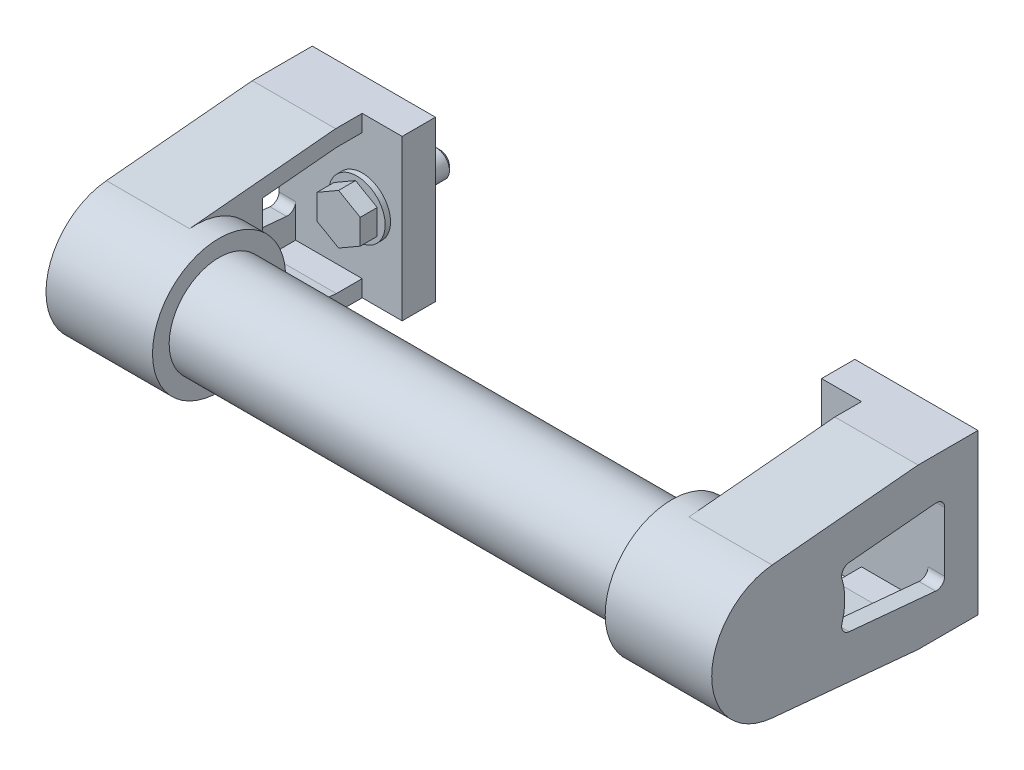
ISO-10303-21;
HEADER;
FILE_DESCRIPTION(('STEP AP214'),'2;1');
FILE_NAME('part.step','',(''),(''),'','','');
FILE_SCHEMA(('AUTOMOTIVE_DESIGN { 1 0 10303 214 1 1 1 1 }'));
ENDSEC;
DATA;
#1=APPLICATION_CONTEXT('core data for automotive mechanical design processes');
#2=APPLICATION_PROTOCOL_DEFINITION('international standard','automotive_design',2000,#1);
#3=PRODUCT_CONTEXT('',#1,'mechanical');
#4=PRODUCT('Part','Part','',(#3));
#5=PRODUCT_RELATED_PRODUCT_CATEGORY('part','',(#4));
#6=PRODUCT_DEFINITION_FORMATION('','',#4);
#7=PRODUCT_DEFINITION_CONTEXT('part definition',#1,'design');
#8=PRODUCT_DEFINITION('design','',#6,#7);
#9=PRODUCT_DEFINITION_SHAPE('','',#8);
#10=(LENGTH_UNIT() NAMED_UNIT(*) SI_UNIT(.MILLI.,.METRE.));
#11=(NAMED_UNIT(*) PLANE_ANGLE_UNIT() SI_UNIT($,.RADIAN.));
#12=(NAMED_UNIT(*) SI_UNIT($,.STERADIAN.) SOLID_ANGLE_UNIT());
#13=UNCERTAINTY_MEASURE_WITH_UNIT(LENGTH_MEASURE(1.E-05),#10,'distance_accuracy_value','');
#14=(GEOMETRIC_REPRESENTATION_CONTEXT(3) GLOBAL_UNCERTAINTY_ASSIGNED_CONTEXT((#13)) GLOBAL_UNIT_ASSIGNED_CONTEXT((#10,
#11,#12)) REPRESENTATION_CONTEXT('',''));
#15=CARTESIAN_POINT('',(0.,0.,0.));
#16=DIRECTION('',(0.,0.,1.));
#17=DIRECTION('',(1.,0.,0.));
#18=AXIS2_PLACEMENT_3D('',#15,#16,#17);
#19=CARTESIAN_POINT('',(134.,24.,18.0000000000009));
#20=DIRECTION('',(0.,-0.995687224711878,-0.0927736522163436));
#21=DIRECTION('',(0.,-0.0927736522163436,0.995687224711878));
#22=AXIS2_PLACEMENT_3D('',#19,#20,#21);
#23=PLANE('',#22);
#24=DIRECTION('',(0.,-0.0927736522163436,0.995687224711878));
#25=VECTOR('',#24,1.);
#26=CARTESIAN_POINT('',(150.,24.,18.0000000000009));
#27=LINE('',#26,#25);
#28=CARTESIAN_POINT('',(150.,19.9137444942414,61.8554730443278));
#29=VERTEX_POINT('',#28);
#30=CARTESIAN_POINT('',(150.,24.0000000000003,17.999999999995));
#31=VERTEX_POINT('',#30);
#32=EDGE_CURVE('E1087',#29,#31,#27,.F.);
#33=ORIENTED_EDGE('',*,*,#32,.F.);
#34=DIRECTION('',(1.,0.,0.));
#35=VECTOR('',#34,1.);
#36=CARTESIAN_POINT('',(143.,19.9137444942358,61.8554730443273));
#37=LINE('',#36,#35);
#38=CARTESIAN_POINT('',(175.,19.913744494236,61.8554730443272));
#39=VERTEX_POINT('',#38);
#40=EDGE_CURVE('E1039',#39,#29,#37,.F.);
#41=ORIENTED_EDGE('',*,*,#40,.F.);
#42=DIRECTION('',(0.,-0.0927736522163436,0.995687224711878));
#43=VECTOR('',#42,1.);
#44=CARTESIAN_POINT('',(175.,24.,18.0000000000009));
#45=LINE('',#44,#43);
#46=CARTESIAN_POINT('',(175.,24.0000000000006,17.999999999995));
#47=VERTEX_POINT('',#46);
#48=EDGE_CURVE('E1042',#47,#39,#45,.T.);
#49=ORIENTED_EDGE('',*,*,#48,.F.);
#50=DIRECTION('',(-1.,0.,0.));
#51=VECTOR('',#50,1.);
#52=CARTESIAN_POINT('',(134.,24.0000000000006,17.999999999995));
#53=LINE('',#52,#51);
#54=EDGE_CURVE('E1081',#31,#47,#53,.F.);
#55=ORIENTED_EDGE('',*,*,#54,.F.);
#56=EDGE_LOOP('',(#33,#41,#49,#55));
#57=FACE_BOUND('',#56,.T.);
#58=ADVANCED_FACE('F14',(#57),#23,.F.);
#59=CARTESIAN_POINT('',(134.,-24.,17.999999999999));
#60=DIRECTION('',(0.,-0.995687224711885,0.092773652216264));
#61=DIRECTION('',(0.,0.092773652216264,0.995687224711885));
#62=AXIS2_PLACEMENT_3D('',#59,#60,#61);
#63=PLANE('',#62);
#64=DIRECTION('',(-1.,0.,0.));
#65=VECTOR('',#64,1.);
#66=CARTESIAN_POINT('',(134.,-19.9137444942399,61.8554730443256));
#67=LINE('',#66,#65);
#68=CARTESIAN_POINT('',(175.,-19.9137444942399,61.8554730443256));
#69=VERTEX_POINT('',#68);
#70=CARTESIAN_POINT('',(150.,-19.9137444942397,61.8554730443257));
#71=VERTEX_POINT('',#70);
#72=EDGE_CURVE('E1034',#69,#71,#67,.T.);
#73=ORIENTED_EDGE('',*,*,#72,.T.);
#74=DIRECTION('',(0.,0.092773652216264,0.995687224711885));
#75=VECTOR('',#74,1.);
#76=CARTESIAN_POINT('',(150.,-24.,17.999999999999));
#77=LINE('',#76,#75);
#78=CARTESIAN_POINT('',(150.,-24.0000000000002,17.999999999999));
#79=VERTEX_POINT('',#78);
#80=EDGE_CURVE('E1067',#71,#79,#77,.F.);
#81=ORIENTED_EDGE('',*,*,#80,.T.);
#82=DIRECTION('',(-1.,0.,0.));
#83=VECTOR('',#82,1.);
#84=CARTESIAN_POINT('',(134.,-24.,17.999999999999));
#85=LINE('',#84,#83);
#86=CARTESIAN_POINT('',(175.,-24.0000000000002,17.999999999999));
#87=VERTEX_POINT('',#86);
#88=EDGE_CURVE('E1045',#79,#87,#85,.F.);
#89=ORIENTED_EDGE('',*,*,#88,.T.);
#90=DIRECTION('',(0.,0.092773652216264,0.995687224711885));
#91=VECTOR('',#90,1.);
#92=CARTESIAN_POINT('',(175.,-24.,17.999999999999));
#93=LINE('',#92,#91);
#94=EDGE_CURVE('E1038',#87,#69,#93,.T.);
#95=ORIENTED_EDGE('',*,*,#94,.T.);
#96=EDGE_LOOP('',(#73,#81,#89,#95));
#97=FACE_BOUND('',#96,.T.);
#98=ADVANCED_FACE('F665',(#97),#63,.T.);
#99=CARTESIAN_POINT('',(16.,-23.9999999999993,18.0000000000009));
#100=DIRECTION('',(0.,0.995687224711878,-0.0927736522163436));
#101=DIRECTION('',(0.,0.0927736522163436,0.995687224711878));
#102=AXIS2_PLACEMENT_3D('',#99,#100,#101);
#103=PLANE('',#102);
#104=DIRECTION('',(0.,0.0927736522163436,0.995687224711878));
#105=VECTOR('',#104,1.);
#106=CARTESIAN_POINT('',(0.,-23.9999999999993,18.0000000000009));
#107=LINE('',#106,#105);
#108=CARTESIAN_POINT('',(0.,-19.9137444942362,61.8554730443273));
#109=VERTEX_POINT('',#108);
#110=CARTESIAN_POINT('',(0.,-23.9999999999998,17.999999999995));
#111=VERTEX_POINT('',#110);
#112=EDGE_CURVE('E426',#109,#111,#107,.F.);
#113=ORIENTED_EDGE('',*,*,#112,.F.);
#114=DIRECTION('',(-1.,0.,0.));
#115=VECTOR('',#114,1.);
#116=CARTESIAN_POINT('',(7.,-19.9137444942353,61.8554730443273));
#117=LINE('',#116,#115);
#118=CARTESIAN_POINT('',(-25.,-19.9137444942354,61.8554730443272));
#119=VERTEX_POINT('',#118);
#120=EDGE_CURVE('E422',#119,#109,#117,.F.);
#121=ORIENTED_EDGE('',*,*,#120,.F.);
#122=DIRECTION('',(0.,0.0927736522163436,0.995687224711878));
#123=VECTOR('',#122,1.);
#124=CARTESIAN_POINT('',(-25.,-23.9999999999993,18.0000000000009));
#125=LINE('',#124,#123);
#126=CARTESIAN_POINT('',(-25.,-24.,17.999999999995));
#127=VERTEX_POINT('',#126);
#128=EDGE_CURVE('E531',#127,#119,#125,.T.);
#129=ORIENTED_EDGE('',*,*,#128,.F.);
#130=DIRECTION('',(1.,0.,0.));
#131=VECTOR('',#130,1.);
#132=CARTESIAN_POINT('',(16.,-24.,17.999999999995));
#133=LINE('',#132,#131);
#134=EDGE_CURVE('E551',#111,#127,#133,.F.);
#135=ORIENTED_EDGE('',*,*,#134,.F.);
#136=EDGE_LOOP('',(#113,#121,#129,#135));
#137=FACE_BOUND('',#136,.T.);
#138=ADVANCED_FACE('F663',(#137),#103,.F.);
#139=CARTESIAN_POINT('',(16.,24.0000000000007,17.999999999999));
#140=DIRECTION('',(0.,0.995687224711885,0.092773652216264));
#141=DIRECTION('',(0.,-0.092773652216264,0.995687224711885));
#142=AXIS2_PLACEMENT_3D('',#139,#140,#141);
#143=PLANE('',#142);
#144=DIRECTION('',(1.,0.,0.));
#145=VECTOR('',#144,1.);
#146=CARTESIAN_POINT('',(16.,19.9137444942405,61.8554730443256));
#147=LINE('',#146,#145);
#148=CARTESIAN_POINT('',(-25.,19.9137444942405,61.8554730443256));
#149=VERTEX_POINT('',#148);
#150=CARTESIAN_POINT('',(0.,19.9137444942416,61.8554730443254));
#151=VERTEX_POINT('',#150);
#152=EDGE_CURVE('E418',#149,#151,#147,.T.);
#153=ORIENTED_EDGE('',*,*,#152,.T.);
#154=DIRECTION('',(0.,-0.092773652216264,0.995687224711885));
#155=VECTOR('',#154,1.);
#156=CARTESIAN_POINT('',(0.,24.0000000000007,17.999999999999));
#157=LINE('',#156,#155);
#158=CARTESIAN_POINT('',(0.,24.0000000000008,17.999999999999));
#159=VERTEX_POINT('',#158);
#160=EDGE_CURVE('E421',#151,#159,#157,.F.);
#161=ORIENTED_EDGE('',*,*,#160,.T.);
#162=DIRECTION('',(1.,0.,0.));
#163=VECTOR('',#162,1.);
#164=CARTESIAN_POINT('',(16.,24.0000000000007,17.999999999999));
#165=LINE('',#164,#163);
#166=CARTESIAN_POINT('',(-25.,24.0000000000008,17.999999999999));
#167=VERTEX_POINT('',#166);
#168=EDGE_CURVE('E534',#159,#167,#165,.F.);
#169=ORIENTED_EDGE('',*,*,#168,.T.);
#170=DIRECTION('',(0.,-0.092773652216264,0.995687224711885));
#171=VECTOR('',#170,1.);
#172=CARTESIAN_POINT('',(-25.,24.0000000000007,17.999999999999));
#173=LINE('',#172,#171);
#174=EDGE_CURVE('E528',#167,#149,#173,.T.);
#175=ORIENTED_EDGE('',*,*,#174,.T.);
#176=EDGE_LOOP('',(#153,#161,#169,#175));
#177=FACE_BOUND('',#176,.T.);
#178=ADVANCED_FACE('F657',(#177),#143,.T.);
#179=CARTESIAN_POINT('',(150.,-1.90385901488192E-13,17.1));
#180=DIRECTION('',(0.,0.,1.));
#181=DIRECTION('',(0.,1.,0.));
#182=AXIS2_PLACEMENT_3D('',#179,#180,#181);
#183=PLANE('',#182);
#184=DIRECTION('',(0.866025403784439,-0.5,0.));
#185=VECTOR('',#184,1.);
#186=CARTESIAN_POINT('',(143.5,-3.75277674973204,17.1));
#187=LINE('',#186,#185);
#188=CARTESIAN_POINT('',(143.5,-3.75277674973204,17.1));
#189=VERTEX_POINT('',#188);
#190=CARTESIAN_POINT('',(150.,-7.50555349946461,17.1));
#191=VERTEX_POINT('',#190);
#192=EDGE_CURVE('E474',#189,#191,#187,.T.);
#193=ORIENTED_EDGE('',*,*,#192,.T.);
#194=DIRECTION('',(0.866025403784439,0.5,0.));
#195=VECTOR('',#194,1.);
#196=CARTESIAN_POINT('',(150.,-7.50555349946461,17.1));
#197=LINE('',#196,#195);
#198=CARTESIAN_POINT('',(156.5,-3.75277674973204,17.1));
#199=VERTEX_POINT('',#198);
#200=EDGE_CURVE('E479',#191,#199,#197,.T.);
#201=ORIENTED_EDGE('',*,*,#200,.T.);
#202=DIRECTION('',(0.,1.,0.));
#203=VECTOR('',#202,1.);
#204=CARTESIAN_POINT('',(156.5,-3.75277674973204,17.1));
#205=LINE('',#204,#203);
#206=CARTESIAN_POINT('',(156.5,3.7527767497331,17.1));
#207=VERTEX_POINT('',#206);
#208=EDGE_CURVE('E1015',#199,#207,#205,.T.);
#209=ORIENTED_EDGE('',*,*,#208,.T.);
#210=DIRECTION('',(-0.866025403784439,0.5,0.));
#211=VECTOR('',#210,1.);
#212=CARTESIAN_POINT('',(156.5,3.7527767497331,17.1));
#213=LINE('',#212,#211);
#214=CARTESIAN_POINT('',(150.,7.50555349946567,17.1));
#215=VERTEX_POINT('',#214);
#216=EDGE_CURVE('E1018',#207,#215,#213,.T.);
#217=ORIENTED_EDGE('',*,*,#216,.T.);
#218=DIRECTION('',(-0.866025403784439,-0.5,0.));
#219=VECTOR('',#218,1.);
#220=CARTESIAN_POINT('',(150.,7.50555349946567,17.1));
#221=LINE('',#220,#219);
#222=CARTESIAN_POINT('',(143.5,3.7527767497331,17.1));
#223=VERTEX_POINT('',#222);
#224=EDGE_CURVE('E1003',#215,#223,#221,.T.);
#225=ORIENTED_EDGE('',*,*,#224,.T.);
#226=DIRECTION('',(0.,-1.,0.));
#227=VECTOR('',#226,1.);
#228=CARTESIAN_POINT('',(143.5,3.7527767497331,17.1));
#229=LINE('',#228,#227);
#230=EDGE_CURVE('E999',#223,#189,#229,.T.);
#231=ORIENTED_EDGE('',*,*,#230,.T.);
#232=EDGE_LOOP('',(#193,#201,#209,#217,#225,#231));
#233=FACE_BOUND('',#232,.T.);
#234=ADVANCED_FACE('F672',(#233),#183,.T.);
#235=CARTESIAN_POINT('',(143.5,3.7527767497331,12.));
#236=DIRECTION('',(-1.,0.,0.));
#237=DIRECTION('',(0.,0.,-1.));
#238=AXIS2_PLACEMENT_3D('',#235,#236,#237);
#239=PLANE('',#238);
#240=DIRECTION('',(0.,-1.,0.));
#241=VECTOR('',#240,1.);
#242=CARTESIAN_POINT('',(143.5,3.7527767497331,12.));
#243=LINE('',#242,#241);
#244=CARTESIAN_POINT('',(143.5,3.7527767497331,12.));
#245=VERTEX_POINT('',#244);
#246=CARTESIAN_POINT('',(143.5,-3.75277674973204,12.));
#247=VERTEX_POINT('',#246);
#248=EDGE_CURVE('E972',#245,#247,#243,.T.);
#249=ORIENTED_EDGE('',*,*,#248,.T.);
#250=DIRECTION('',(0.,0.,1.));
#251=VECTOR('',#250,1.);
#252=CARTESIAN_POINT('',(143.5,-3.75277674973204,12.));
#253=LINE('',#252,#251);
#254=EDGE_CURVE('E976',#247,#189,#253,.T.);
#255=ORIENTED_EDGE('',*,*,#254,.T.);
#256=ORIENTED_EDGE('',*,*,#230,.F.);
#257=DIRECTION('',(0.,0.,1.));
#258=VECTOR('',#257,1.);
#259=CARTESIAN_POINT('',(143.5,3.7527767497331,12.));
#260=LINE('',#259,#258);
#261=EDGE_CURVE('E980',#245,#223,#260,.T.);
#262=ORIENTED_EDGE('',*,*,#261,.F.);
#263=EDGE_LOOP('',(#249,#255,#256,#262));
#264=FACE_BOUND('',#263,.T.);
#265=ADVANCED_FACE('F803',(#264),#239,.T.);
#266=CARTESIAN_POINT('',(143.5,-3.75277674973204,12.));
#267=DIRECTION('',(-0.5,-0.866025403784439,0.));
#268=DIRECTION('',(0.866025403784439,-0.5,0.));
#269=AXIS2_PLACEMENT_3D('',#266,#267,#268);
#270=PLANE('',#269);
#271=ORIENTED_EDGE('',*,*,#192,.F.);
#272=ORIENTED_EDGE('',*,*,#254,.F.);
#273=DIRECTION('',(0.866025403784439,-0.5,0.));
#274=VECTOR('',#273,1.);
#275=CARTESIAN_POINT('',(143.5,-3.75277674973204,12.));
#276=LINE('',#275,#274);
#277=CARTESIAN_POINT('',(150.,-7.50555349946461,12.));
#278=VERTEX_POINT('',#277);
#279=EDGE_CURVE('E991',#247,#278,#276,.T.);
#280=ORIENTED_EDGE('',*,*,#279,.T.);
#281=DIRECTION('',(0.,0.,1.));
#282=VECTOR('',#281,1.);
#283=CARTESIAN_POINT('',(150.,-7.50555349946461,12.));
#284=LINE('',#283,#282);
#285=EDGE_CURVE('E985',#278,#191,#284,.T.);
#286=ORIENTED_EDGE('',*,*,#285,.T.);
#287=EDGE_LOOP('',(#271,#272,#280,#286));
#288=FACE_BOUND('',#287,.T.);
#289=ADVANCED_FACE('F944',(#288),#270,.T.);
#290=CARTESIAN_POINT('',(150.,-7.50555349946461,12.));
#291=DIRECTION('',(0.5,-0.866025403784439,0.));
#292=DIRECTION('',(0.866025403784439,0.5,0.));
#293=AXIS2_PLACEMENT_3D('',#290,#291,#292);
#294=PLANE('',#293);
#295=ORIENTED_EDGE('',*,*,#200,.F.);
#296=ORIENTED_EDGE('',*,*,#285,.F.);
#297=DIRECTION('',(0.866025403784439,0.5,0.));
#298=VECTOR('',#297,1.);
#299=CARTESIAN_POINT('',(150.,-7.50555349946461,12.));
#300=LINE('',#299,#298);
#301=CARTESIAN_POINT('',(156.5,-3.75277674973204,12.));
#302=VERTEX_POINT('',#301);
#303=EDGE_CURVE('E998',#278,#302,#300,.T.);
#304=ORIENTED_EDGE('',*,*,#303,.T.);
#305=DIRECTION('',(0.,0.,1.));
#306=VECTOR('',#305,1.);
#307=CARTESIAN_POINT('',(156.5,-3.75277674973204,12.));
#308=LINE('',#307,#306);
#309=EDGE_CURVE('E1030',#302,#199,#308,.T.);
#310=ORIENTED_EDGE('',*,*,#309,.T.);
#311=EDGE_LOOP('',(#295,#296,#304,#310));
#312=FACE_BOUND('',#311,.T.);
#313=ADVANCED_FACE('F947',(#312),#294,.T.);
#314=CARTESIAN_POINT('',(156.5,-3.75277674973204,12.));
#315=DIRECTION('',(1.,0.,0.));
#316=DIRECTION('',(0.,0.,1.));
#317=AXIS2_PLACEMENT_3D('',#314,#315,#316);
#318=PLANE('',#317);
#319=DIRECTION('',(0.,1.,0.));
#320=VECTOR('',#319,1.);
#321=CARTESIAN_POINT('',(156.5,-3.75277674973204,12.));
#322=LINE('',#321,#320);
#323=CARTESIAN_POINT('',(156.5,3.7527767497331,12.));
#324=VERTEX_POINT('',#323);
#325=EDGE_CURVE('E1001',#302,#324,#322,.T.);
#326=ORIENTED_EDGE('',*,*,#325,.T.);
#327=DIRECTION('',(0.,0.,1.));
#328=VECTOR('',#327,1.);
#329=CARTESIAN_POINT('',(156.5,3.7527767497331,12.));
#330=LINE('',#329,#328);
#331=EDGE_CURVE('E1027',#324,#207,#330,.T.);
#332=ORIENTED_EDGE('',*,*,#331,.T.);
#333=ORIENTED_EDGE('',*,*,#208,.F.);
#334=ORIENTED_EDGE('',*,*,#309,.F.);
#335=EDGE_LOOP('',(#326,#332,#333,#334));
#336=FACE_BOUND('',#335,.T.);
#337=ADVANCED_FACE('F951',(#336),#318,.T.);
#338=CARTESIAN_POINT('',(156.5,3.7527767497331,12.));
#339=DIRECTION('',(0.5,0.866025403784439,0.));
#340=DIRECTION('',(-0.866025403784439,0.5,0.));
#341=AXIS2_PLACEMENT_3D('',#338,#339,#340);
#342=PLANE('',#341);
#343=DIRECTION('',(-0.866025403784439,0.5,0.));
#344=VECTOR('',#343,1.);
#345=CARTESIAN_POINT('',(156.5,3.7527767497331,12.));
#346=LINE('',#345,#344);
#347=CARTESIAN_POINT('',(150.,7.50555349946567,12.));
#348=VERTEX_POINT('',#347);
#349=EDGE_CURVE('E1008',#324,#348,#346,.T.);
#350=ORIENTED_EDGE('',*,*,#349,.T.);
#351=DIRECTION('',(0.,0.,1.));
#352=VECTOR('',#351,1.);
#353=CARTESIAN_POINT('',(150.,7.50555349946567,12.));
#354=LINE('',#353,#352);
#355=EDGE_CURVE('E1024',#348,#215,#354,.T.);
#356=ORIENTED_EDGE('',*,*,#355,.T.);
#357=ORIENTED_EDGE('',*,*,#216,.F.);
#358=ORIENTED_EDGE('',*,*,#331,.F.);
#359=EDGE_LOOP('',(#350,#356,#357,#358));
#360=FACE_BOUND('',#359,.T.);
#361=ADVANCED_FACE('F955',(#360),#342,.T.);
#362=CARTESIAN_POINT('',(150.,7.50555349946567,12.));
#363=DIRECTION('',(-0.5,0.866025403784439,0.));
#364=DIRECTION('',(-0.866025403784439,-0.5,0.));
#365=AXIS2_PLACEMENT_3D('',#362,#363,#364);
#366=PLANE('',#365);
#367=DIRECTION('',(-0.866025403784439,-0.5,0.));
#368=VECTOR('',#367,1.);
#369=CARTESIAN_POINT('',(150.,7.50555349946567,12.));
#370=LINE('',#369,#368);
#371=EDGE_CURVE('E986',#348,#245,#370,.T.);
#372=ORIENTED_EDGE('',*,*,#371,.T.);
#373=ORIENTED_EDGE('',*,*,#261,.T.);
#374=ORIENTED_EDGE('',*,*,#224,.F.);
#375=ORIENTED_EDGE('',*,*,#355,.F.);
#376=EDGE_LOOP('',(#372,#373,#374,#375));
#377=FACE_BOUND('',#376,.T.);
#378=ADVANCED_FACE('F799',(#377),#366,.T.);
#379=CARTESIAN_POINT('',(156.5,0.,12.));
#380=DIRECTION('',(0.,0.,-1.));
#381=DIRECTION('',(0.,-1.,0.));
#382=AXIS2_PLACEMENT_3D('',#379,#380,#381);
#383=PLANE('',#382);
#384=CARTESIAN_POINT('',(150.,0.,12.));
#385=DIRECTION('',(0.,0.,1.));
#386=DIRECTION('',(0.,1.,0.));
#387=AXIS2_PLACEMENT_3D('',#384,#385,#386);
#388=CIRCLE('',#387,5.85000000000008);
#389=CARTESIAN_POINT('',(150.,5.85000000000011,12.0000000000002));
#390=VERTEX_POINT('',#389);
#391=EDGE_CURVE('E993',#390,#390,#388,.F.);
#392=ORIENTED_EDGE('',*,*,#391,.F.);
#393=EDGE_LOOP('',(#392));
#394=FACE_BOUND('',#393,.T.);
#395=ORIENTED_EDGE('',*,*,#371,.F.);
#396=ORIENTED_EDGE('',*,*,#349,.F.);
#397=ORIENTED_EDGE('',*,*,#325,.F.);
#398=ORIENTED_EDGE('',*,*,#303,.F.);
#399=ORIENTED_EDGE('',*,*,#279,.F.);
#400=ORIENTED_EDGE('',*,*,#248,.F.);
#401=EDGE_LOOP('',(#395,#396,#397,#398,#399,#400));
#402=FACE_BOUND('',#401,.T.);
#403=ADVANCED_FACE('F795',(#394,#402),#383,.T.);
#404=CARTESIAN_POINT('',(150.,1.08637057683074E-12,-13.4));
#405=DIRECTION('',(0.,0.,1.));
#406=DIRECTION('',(0.,1.,0.));
#407=AXIS2_PLACEMENT_3D('',#404,#405,#406);
#408=PLANE('',#407);
#409=CARTESIAN_POINT('',(150.,1.09186343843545E-12,-13.4));
#410=DIRECTION('',(0.,0.,1.));
#411=DIRECTION('',(0.,1.,0.));
#412=AXIS2_PLACEMENT_3D('',#409,#410,#411);
#413=CIRCLE('',#412,2.79999999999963);
#414=CARTESIAN_POINT('',(150.,2.80000000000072,-13.3999999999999));
#415=VERTEX_POINT('',#414);
#416=EDGE_CURVE('E24',#415,#415,#413,.F.);
#417=ORIENTED_EDGE('',*,*,#416,.T.);
#418=EDGE_LOOP('',(#417));
#419=FACE_BOUND('',#418,.T.);
#420=ADVANCED_FACE('F791',(#419),#408,.F.);
#421=CARTESIAN_POINT('',(150.,-2.79941000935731E-12,80.));
#422=DIRECTION('',(0.,0.,1.));
#423=DIRECTION('',(0.,1.,0.));
#424=AXIS2_PLACEMENT_3D('',#421,#422,#423);
#425=CYLINDRICAL_SURFACE('',#424,5.85000000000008);
#426=ORIENTED_EDGE('',*,*,#391,.T.);
#427=EDGE_LOOP('',(#426));
#428=FACE_BOUND('',#427,.T.);
#429=CARTESIAN_POINT('',(150.,0.,11.6));
#430=DIRECTION('',(0.,0.,1.));
#431=DIRECTION('',(0.,1.,0.));
#432=AXIS2_PLACEMENT_3D('',#429,#430,#431);
#433=CIRCLE('',#432,5.85000000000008);
#434=CARTESIAN_POINT('',(150.,5.85000000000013,11.6000000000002));
#435=VERTEX_POINT('',#434);
#436=EDGE_CURVE('E1250',#435,#435,#433,.F.);
#437=ORIENTED_EDGE('',*,*,#436,.F.);
#438=EDGE_LOOP('',(#437));
#439=FACE_BOUND('',#438,.T.);
#440=ADVANCED_FACE('F788',(#428,#439),#425,.T.);
#441=CARTESIAN_POINT('',(150.,1.04190340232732E-12,-12.2));
#442=DIRECTION('',(0.,0.,1.));
#443=DIRECTION('',(0.,1.,0.));
#444=AXIS2_PLACEMENT_3D('',#441,#442,#443);
#445=CONICAL_SURFACE('',#444,3.99999999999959,0.785398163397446);
#446=ORIENTED_EDGE('',*,*,#416,.F.);
#447=EDGE_LOOP('',(#446));
#448=FACE_BOUND('',#447,.T.);
#449=CARTESIAN_POINT('',(150.,1.04190340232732E-12,-12.2));
#450=DIRECTION('',(0.,0.,1.));
#451=DIRECTION('',(0.,1.,0.));
#452=AXIS2_PLACEMENT_3D('',#449,#450,#451);
#453=CIRCLE('',#452,3.99999999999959);
#454=CARTESIAN_POINT('',(150.,4.00000000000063,-12.1999999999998));
#455=VERTEX_POINT('',#454);
#456=EDGE_CURVE('E1221',#455,#455,#453,.T.);
#457=ORIENTED_EDGE('',*,*,#456,.F.);
#458=EDGE_LOOP('',(#457));
#459=FACE_BOUND('',#458,.T.);
#460=ADVANCED_FACE('F786',(#448,#459),#445,.T.);
#461=CARTESIAN_POINT('',(155.85,0.,11.6));
#462=DIRECTION('',(0.,0.,1.));
#463=DIRECTION('',(0.,1.,0.));
#464=AXIS2_PLACEMENT_3D('',#461,#462,#463);
#465=PLANE('',#464);
#466=CARTESIAN_POINT('',(150.,0.,11.6));
#467=DIRECTION('',(0.,0.,1.));
#468=DIRECTION('',(0.,1.,0.));
#469=AXIS2_PLACEMENT_3D('',#466,#467,#468);
#470=CIRCLE('',#469,8.50000000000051);
#471=CARTESIAN_POINT('',(150.,8.50000000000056,11.6000000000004));
#472=VERTEX_POINT('',#471);
#473=EDGE_CURVE('E1207',#472,#472,#470,.F.);
#474=ORIENTED_EDGE('',*,*,#473,.F.);
#475=EDGE_LOOP('',(#474));
#476=FACE_BOUND('',#475,.T.);
#477=ORIENTED_EDGE('',*,*,#436,.T.);
#478=EDGE_LOOP('',(#477));
#479=FACE_BOUND('',#478,.T.);
#480=ADVANCED_FACE('F782',(#476,#479),#465,.T.);
#481=CARTESIAN_POINT('',(150.,0.,12.7319341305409));
#482=DIRECTION('',(0.,0.,1.));
#483=DIRECTION('',(0.,1.,0.));
#484=AXIS2_PLACEMENT_3D('',#481,#482,#483);
#485=CYLINDRICAL_SURFACE('',#484,3.99999999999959);
#486=ORIENTED_EDGE('',*,*,#456,.T.);
#487=EDGE_LOOP('',(#486));
#488=FACE_BOUND('',#487,.T.);
#489=CARTESIAN_POINT('',(150.,5.3397636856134E-13,0.));
#490=DIRECTION('',(0.,0.,1.));
#491=DIRECTION('',(0.,1.,0.));
#492=AXIS2_PLACEMENT_3D('',#489,#490,#491);
#493=CIRCLE('',#492,3.99999999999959);
#494=CARTESIAN_POINT('',(150.,4.00000000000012,1.027823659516E-13));
#495=VERTEX_POINT('',#494);
#496=EDGE_CURVE('E1144',#495,#495,#493,.T.);
#497=ORIENTED_EDGE('',*,*,#496,.F.);
#498=EDGE_LOOP('',(#497));
#499=FACE_BOUND('',#498,.T.);
#500=ADVANCED_FACE('F778',(#488,#499),#485,.T.);
#501=CARTESIAN_POINT('',(150.,-2.79941000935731E-12,80.));
#502=DIRECTION('',(0.,0.,1.));
#503=DIRECTION('',(0.,1.,0.));
#504=AXIS2_PLACEMENT_3D('',#501,#502,#503);
#505=CYLINDRICAL_SURFACE('',#504,8.50000000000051);
#506=ORIENTED_EDGE('',*,*,#473,.T.);
#507=EDGE_LOOP('',(#506));
#508=FACE_BOUND('',#507,.T.);
#509=CARTESIAN_POINT('',(150.,1.14925430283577E-13,10.));
#510=DIRECTION('',(0.,0.,1.));
#511=DIRECTION('',(0.,1.,0.));
#512=AXIS2_PLACEMENT_3D('',#509,#510,#511);
#513=CIRCLE('',#512,8.50000000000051);
#514=CARTESIAN_POINT('',(150.,8.50000000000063,10.0000000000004));
#515=VERTEX_POINT('',#514);
#516=EDGE_CURVE('E1116',#515,#515,#513,.T.);
#517=ORIENTED_EDGE('',*,*,#516,.T.);
#518=EDGE_LOOP('',(#517));
#519=FACE_BOUND('',#518,.T.);
#520=ADVANCED_FACE('F774',(#508,#519),#505,.T.);
#521=CARTESIAN_POINT('',(170.,18.9999999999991,40.0000000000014));
#522=DIRECTION('',(-1.,0.,0.));
#523=DIRECTION('',(0.,0.,-1.));
#524=AXIS2_PLACEMENT_3D('',#521,#522,#523);
#525=PLANE('',#524);
#526=DIRECTION('',(0.,-1.,0.));
#527=VECTOR('',#526,1.);
#528=CARTESIAN_POINT('',(170.,23.9999999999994,40.0000000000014));
#529=LINE('',#528,#527);
#530=CARTESIAN_POINT('',(170.,16.9284817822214,40.0000000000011));
#531=VERTEX_POINT('',#530);
#532=CARTESIAN_POINT('',(170.,8.50076165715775,40.0000000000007));
#533=VERTEX_POINT('',#532);
#534=EDGE_CURVE('E1188',#531,#533,#529,.T.);
#535=ORIENTED_EDGE('',*,*,#534,.F.);
#536=DIRECTION('',(0.,0.0927736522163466,-0.995687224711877));
#537=VECTOR('',#536,1.);
#538=CARTESIAN_POINT('',(170.,19.,17.7675646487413));
#539=LINE('',#538,#537);
#540=CARTESIAN_POINT('',(170.,19.,17.7675646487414));
#541=VERTEX_POINT('',#540);
#542=EDGE_CURVE('E1194',#531,#541,#539,.T.);
#543=ORIENTED_EDGE('',*,*,#542,.T.);
#544=DIRECTION('',(0.,0.,-1.));
#545=VECTOR('',#544,1.);
#546=CARTESIAN_POINT('',(170.,19.0000000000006,10.0000000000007));
#547=LINE('',#546,#545);
#548=CARTESIAN_POINT('',(170.,19.0000000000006,10.0000000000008));
#549=VERTEX_POINT('',#548);
#550=EDGE_CURVE('E1204',#541,#549,#547,.T.);
#551=ORIENTED_EDGE('',*,*,#550,.T.);
#552=DIRECTION('',(0.,-1.,0.));
#553=VECTOR('',#552,1.);
#554=CARTESIAN_POINT('',(170.,8.9453276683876,10.0000000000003));
#555=LINE('',#554,#553);
#556=CARTESIAN_POINT('',(170.,8.94532766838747,10.0000000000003));
#557=VERTEX_POINT('',#556);
#558=EDGE_CURVE('E1110',#549,#557,#555,.T.);
#559=ORIENTED_EDGE('',*,*,#558,.T.);
#560=CARTESIAN_POINT('',(170.,8.94532766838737,12.5000000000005));
#561=DIRECTION('',(1.,0.,0.));
#562=DIRECTION('',(0.,0.,1.));
#563=AXIS2_PLACEMENT_3D('',#560,#561,#562);
#564=CIRCLE('',#563,2.5);
#565=CARTESIAN_POINT('',(170.,11.434545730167,12.7319341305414));
#566=VERTEX_POINT('',#565);
#567=EDGE_CURVE('E1117',#557,#566,#564,.T.);
#568=ORIENTED_EDGE('',*,*,#567,.T.);
#569=DIRECTION('',(0.,-0.0927736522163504,0.995687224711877));
#570=VECTOR('',#569,1.);
#571=CARTESIAN_POINT('',(170.,11.4345457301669,12.7319341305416));
#572=LINE('',#571,#570);
#573=CARTESIAN_POINT('',(170.,9.01504355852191,38.6990847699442));
#574=VERTEX_POINT('',#573);
#575=EDGE_CURVE('E1121',#574,#566,#572,.F.);
#576=ORIENTED_EDGE('',*,*,#575,.F.);
#577=CARTESIAN_POINT('',(170.,6.52582549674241,38.4671506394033));
#578=DIRECTION('',(1.,0.,0.));
#579=DIRECTION('',(0.,0.,1.));
#580=AXIS2_PLACEMENT_3D('',#577,#578,#579);
#581=CIRCLE('',#580,2.5);
#582=EDGE_CURVE('E1126',#574,#533,#581,.T.);
#583=ORIENTED_EDGE('',*,*,#582,.T.);
#584=EDGE_LOOP('',(#535,#543,#551,#559,#568,#576,#583));
#585=FACE_BOUND('',#584,.T.);
#586=ADVANCED_FACE('F770',(#585),#525,.T.);
#587=CARTESIAN_POINT('',(170.,18.9999999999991,40.0000000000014));
#588=DIRECTION('',(-1.,0.,0.));
#589=DIRECTION('',(0.,0.,-1.));
#590=AXIS2_PLACEMENT_3D('',#587,#588,#589);
#591=PLANE('',#590);
#592=DIRECTION('',(0.,-1.,0.));
#593=VECTOR('',#592,1.);
#594=CARTESIAN_POINT('',(170.,8.9453276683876,10.0000000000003));
#595=LINE('',#594,#593);
#596=CARTESIAN_POINT('',(170.,-8.94532766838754,9.99999999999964));
#597=VERTEX_POINT('',#596);
#598=CARTESIAN_POINT('',(170.,-19.,9.99999999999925));
#599=VERTEX_POINT('',#598);
#600=EDGE_CURVE('E1113',#597,#599,#595,.T.);
#601=ORIENTED_EDGE('',*,*,#600,.T.);
#602=DIRECTION('',(0.,0.,-1.));
#603=VECTOR('',#602,1.);
#604=CARTESIAN_POINT('',(170.,-19.,9.99999999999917));
#605=LINE('',#604,#603);
#606=CARTESIAN_POINT('',(170.,-19.,17.7675646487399));
#607=VERTEX_POINT('',#606);
#608=EDGE_CURVE('E1168',#607,#599,#605,.T.);
#609=ORIENTED_EDGE('',*,*,#608,.F.);
#610=DIRECTION('',(0.,-0.0927736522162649,-0.995687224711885));
#611=VECTOR('',#610,1.);
#612=CARTESIAN_POINT('',(170.,-19.,17.7675646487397));
#613=LINE('',#612,#611);
#614=CARTESIAN_POINT('',(170.,-16.9284817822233,40.));
#615=VERTEX_POINT('',#614);
#616=EDGE_CURVE('E1169',#615,#607,#613,.T.);
#617=ORIENTED_EDGE('',*,*,#616,.F.);
#618=DIRECTION('',(0.,-1.,0.));
#619=VECTOR('',#618,1.);
#620=CARTESIAN_POINT('',(170.,23.9999999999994,40.0000000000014));
#621=LINE('',#620,#619);
#622=CARTESIAN_POINT('',(170.,-8.50076165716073,40.));
#623=VERTEX_POINT('',#622);
#624=EDGE_CURVE('E1175',#623,#615,#621,.T.);
#625=ORIENTED_EDGE('',*,*,#624,.F.);
#626=CARTESIAN_POINT('',(170.,-6.5258254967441,38.4671506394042));
#627=DIRECTION('',(1.,0.,0.));
#628=DIRECTION('',(0.,0.,1.));
#629=AXIS2_PLACEMENT_3D('',#626,#627,#628);
#630=CIRCLE('',#629,2.5);
#631=CARTESIAN_POINT('',(170.,-9.01504355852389,38.699084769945));
#632=VERTEX_POINT('',#631);
#633=EDGE_CURVE('E1127',#623,#632,#630,.T.);
#634=ORIENTED_EDGE('',*,*,#633,.T.);
#635=DIRECTION('',(0.,0.0927736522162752,0.995687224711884));
#636=VECTOR('',#635,1.);
#637=CARTESIAN_POINT('',(170.,-11.4345457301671,12.7319341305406));
#638=LINE('',#637,#636);
#639=CARTESIAN_POINT('',(170.,-11.4345457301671,12.7319341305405));
#640=VERTEX_POINT('',#639);
#641=EDGE_CURVE('E1131',#632,#640,#638,.F.);
#642=ORIENTED_EDGE('',*,*,#641,.T.);
#643=CARTESIAN_POINT('',(170.,-8.94532766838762,12.4999999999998));
#644=DIRECTION('',(1.,0.,0.));
#645=DIRECTION('',(0.,0.,1.));
#646=AXIS2_PLACEMENT_3D('',#643,#644,#645);
#647=CIRCLE('',#646,2.5);
#648=EDGE_CURVE('E1143',#640,#597,#647,.T.);
#649=ORIENTED_EDGE('',*,*,#648,.T.);
#650=EDGE_LOOP('',(#601,#609,#617,#625,#634,#642,#649));
#651=FACE_BOUND('',#650,.T.);
#652=ADVANCED_FACE('F746',(#651),#591,.T.);
#653=CARTESIAN_POINT('',(138.,24.0000000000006,10.0000000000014));
#654=DIRECTION('',(-1.,0.,0.));
#655=DIRECTION('',(0.,0.,-1.));
#656=AXIS2_PLACEMENT_3D('',#653,#654,#655);
#657=PLANE('',#656);
#658=DIRECTION('',(0.,-1.,0.));
#659=VECTOR('',#658,1.);
#660=CARTESIAN_POINT('',(138.,24.0000000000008,9.35449634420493E-13));
#661=LINE('',#660,#659);
#662=CARTESIAN_POINT('',(138.,-23.9999999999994,-1.02594437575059E-12));
#663=VERTEX_POINT('',#662);
#664=CARTESIAN_POINT('',(138.,24.0000000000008,9.35449634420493E-13));
#665=VERTEX_POINT('',#664);
#666=EDGE_CURVE('E1140',#663,#665,#661,.F.);
#667=ORIENTED_EDGE('',*,*,#666,.F.);
#668=DIRECTION('',(0.,0.,1.));
#669=VECTOR('',#668,1.);
#670=CARTESIAN_POINT('',(138.,-23.9999999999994,-1.06295180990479E-12));
#671=LINE('',#670,#669);
#672=CARTESIAN_POINT('',(138.,-24.,9.99999999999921));
#673=VERTEX_POINT('',#672);
#674=EDGE_CURVE('E1134',#673,#663,#671,.F.);
#675=ORIENTED_EDGE('',*,*,#674,.F.);
#676=DIRECTION('',(0.,-1.,0.));
#677=VECTOR('',#676,1.);
#678=CARTESIAN_POINT('',(138.,8.9453276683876,10.0000000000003));
#679=LINE('',#678,#677);
#680=CARTESIAN_POINT('',(138.,24.0000000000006,10.0000000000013));
#681=VERTEX_POINT('',#680);
#682=EDGE_CURVE('E1149',#673,#681,#679,.F.);
#683=ORIENTED_EDGE('',*,*,#682,.T.);
#684=DIRECTION('',(0.,0.,1.));
#685=VECTOR('',#684,1.);
#686=CARTESIAN_POINT('',(138.,24.0000000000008,9.35449634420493E-13));
#687=LINE('',#686,#685);
#688=EDGE_CURVE('E1139',#681,#665,#687,.F.);
#689=ORIENTED_EDGE('',*,*,#688,.T.);
#690=EDGE_LOOP('',(#667,#675,#683,#689));
#691=FACE_BOUND('',#690,.T.);
#692=ADVANCED_FACE('F742',(#691),#657,.T.);
#693=CARTESIAN_POINT('',(161.,-19.,9.99999999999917));
#694=DIRECTION('',(0.,1.,0.));
#695=DIRECTION('',(0.,0.,-1.));
#696=AXIS2_PLACEMENT_3D('',#693,#694,#695);
#697=PLANE('',#696);
#698=DIRECTION('',(-1.,0.,0.));
#699=VECTOR('',#698,1.);
#700=CARTESIAN_POINT('',(134.,-19.,9.99999999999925));
#701=LINE('',#700,#699);
#702=CARTESIAN_POINT('',(150.,-19.,9.9999999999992));
#703=VERTEX_POINT('',#702);
#704=EDGE_CURVE('E1159',#599,#703,#701,.T.);
#705=ORIENTED_EDGE('',*,*,#704,.T.);
#706=DIRECTION('',(0.,0.,-1.));
#707=VECTOR('',#706,1.);
#708=CARTESIAN_POINT('',(150.,-19.,60.));
#709=LINE('',#708,#707);
#710=CARTESIAN_POINT('',(150.,-19.,17.7675646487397));
#711=VERTEX_POINT('',#710);
#712=EDGE_CURVE('E1156',#711,#703,#709,.T.);
#713=ORIENTED_EDGE('',*,*,#712,.F.);
#714=DIRECTION('',(-1.,0.,0.));
#715=VECTOR('',#714,1.);
#716=CARTESIAN_POINT('',(161.,-19.,17.7675646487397));
#717=LINE('',#716,#715);
#718=EDGE_CURVE('E1165',#711,#607,#717,.F.);
#719=ORIENTED_EDGE('',*,*,#718,.T.);
#720=ORIENTED_EDGE('',*,*,#608,.T.);
#721=EDGE_LOOP('',(#705,#713,#719,#720));
#722=FACE_BOUND('',#721,.T.);
#723=ADVANCED_FACE('F745',(#722),#697,.T.);
#724=CARTESIAN_POINT('',(161.,-19.,17.7675646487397));
#725=DIRECTION('',(0.,0.995687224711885,-0.0927736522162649));
#726=DIRECTION('',(0.,-0.0927736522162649,-0.995687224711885));
#727=AXIS2_PLACEMENT_3D('',#724,#725,#726);
#728=PLANE('',#727);
#729=ORIENTED_EDGE('',*,*,#718,.F.);
#730=DIRECTION('',(0.,-0.0927736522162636,-0.995687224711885));
#731=VECTOR('',#730,1.);
#732=CARTESIAN_POINT('',(150.,-16.9284817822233,40.));
#733=LINE('',#732,#731);
#734=CARTESIAN_POINT('',(150.,-16.9284817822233,40.));
#735=VERTEX_POINT('',#734);
#736=EDGE_CURVE('E1078',#735,#711,#733,.T.);
#737=ORIENTED_EDGE('',*,*,#736,.F.);
#738=DIRECTION('',(-1.,0.,0.));
#739=VECTOR('',#738,1.);
#740=CARTESIAN_POINT('',(161.,-16.9284817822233,40.));
#741=LINE('',#740,#739);
#742=EDGE_CURVE('E1172',#735,#615,#741,.F.);
#743=ORIENTED_EDGE('',*,*,#742,.T.);
#744=ORIENTED_EDGE('',*,*,#616,.T.);
#745=EDGE_LOOP('',(#729,#737,#743,#744));
#746=FACE_BOUND('',#745,.T.);
#747=ADVANCED_FACE('F750',(#746),#728,.T.);
#748=CARTESIAN_POINT('',(146.,23.9999999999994,40.0000000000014));
#749=DIRECTION('',(0.,0.,-1.));
#750=DIRECTION('',(0.,-1.,0.));
#751=AXIS2_PLACEMENT_3D('',#748,#749,#750);
#752=PLANE('',#751);
#753=DIRECTION('',(1.,0.,0.));
#754=VECTOR('',#753,1.);
#755=CARTESIAN_POINT('',(134.,-8.50076165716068,40.));
#756=LINE('',#755,#754);
#757=CARTESIAN_POINT('',(150.,-8.50076165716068,40.));
#758=VERTEX_POINT('',#757);
#759=EDGE_CURVE('E1130',#758,#623,#756,.T.);
#760=ORIENTED_EDGE('',*,*,#759,.T.);
#761=ORIENTED_EDGE('',*,*,#624,.T.);
#762=ORIENTED_EDGE('',*,*,#742,.F.);
#763=DIRECTION('',(0.,-1.,0.));
#764=VECTOR('',#763,1.);
#765=CARTESIAN_POINT('',(150.,-2.09164283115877E-12,40.));
#766=LINE('',#765,#764);
#767=EDGE_CURVE('E1075',#758,#735,#766,.T.);
#768=ORIENTED_EDGE('',*,*,#767,.F.);
#769=EDGE_LOOP('',(#760,#761,#762,#768));
#770=FACE_BOUND('',#769,.T.);
#771=ADVANCED_FACE('F740',(#770),#752,.T.);
#772=CARTESIAN_POINT('',(134.,24.0000000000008,9.35449634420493E-13));
#773=DIRECTION('',(0.,0.,-1.));
#774=DIRECTION('',(0.,-1.,0.));
#775=AXIS2_PLACEMENT_3D('',#772,#773,#774);
#776=PLANE('',#775);
#777=DIRECTION('',(-1.,0.,0.));
#778=VECTOR('',#777,1.);
#779=CARTESIAN_POINT('',(134.,24.0000000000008,9.35449634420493E-13));
#780=LINE('',#779,#778);
#781=CARTESIAN_POINT('',(175.,24.0000000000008,-3.96817995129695E-13));
#782=VERTEX_POINT('',#781);
#783=EDGE_CURVE('E1091',#665,#782,#780,.F.);
#784=ORIENTED_EDGE('',*,*,#783,.T.);
#785=DIRECTION('',(0.,-1.,0.));
#786=VECTOR('',#785,1.);
#787=CARTESIAN_POINT('',(175.,-2.09164283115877E-12,-1.06295180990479E-12));
#788=LINE('',#787,#786);
#789=CARTESIAN_POINT('',(175.,-24.,-1.06295180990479E-12));
#790=VERTEX_POINT('',#789);
#791=EDGE_CURVE('E1063',#790,#782,#788,.F.);
#792=ORIENTED_EDGE('',*,*,#791,.F.);
#793=DIRECTION('',(-1.,0.,0.));
#794=VECTOR('',#793,1.);
#795=CARTESIAN_POINT('',(134.,-23.9999999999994,-1.06295180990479E-12));
#796=LINE('',#795,#794);
#797=EDGE_CURVE('E1084',#663,#790,#796,.F.);
#798=ORIENTED_EDGE('',*,*,#797,.F.);
#799=ORIENTED_EDGE('',*,*,#666,.T.);
#800=EDGE_LOOP('',(#784,#792,#798,#799));
#801=FACE_BOUND('',#800,.T.);
#802=ORIENTED_EDGE('',*,*,#496,.T.);
#803=EDGE_LOOP('',(#802));
#804=FACE_BOUND('',#803,.T.);
#805=ADVANCED_FACE('F733',(#801,#804),#776,.T.);
#806=CARTESIAN_POINT('',(143.,-11.4345457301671,12.7319341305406));
#807=DIRECTION('',(0.,-0.995687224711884,0.0927736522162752));
#808=DIRECTION('',(0.,0.0927736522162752,0.995687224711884));
#809=AXIS2_PLACEMENT_3D('',#806,#807,#808);
#810=PLANE('',#809);
#811=DIRECTION('',(0.,0.0927736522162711,0.995687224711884));
#812=VECTOR('',#811,1.);
#813=CARTESIAN_POINT('',(175.,-11.4345457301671,12.7319341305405));
#814=LINE('',#813,#812);
#815=CARTESIAN_POINT('',(175.,-11.4345457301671,12.7319341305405));
#816=VERTEX_POINT('',#815);
#817=CARTESIAN_POINT('',(175.,-9.01504355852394,38.699084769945));
#818=VERTEX_POINT('',#817);
#819=EDGE_CURVE('E1055',#816,#818,#814,.T.);
#820=ORIENTED_EDGE('',*,*,#819,.F.);
#821=DIRECTION('',(-1.,0.,0.));
#822=VECTOR('',#821,1.);
#823=CARTESIAN_POINT('',(143.,-11.4345457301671,12.7319341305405));
#824=LINE('',#823,#822);
#825=EDGE_CURVE('E1128',#640,#816,#824,.F.);
#826=ORIENTED_EDGE('',*,*,#825,.F.);
#827=ORIENTED_EDGE('',*,*,#641,.F.);
#828=DIRECTION('',(1.,0.,0.));
#829=VECTOR('',#828,1.);
#830=CARTESIAN_POINT('',(134.,-9.01504355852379,38.6990847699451));
#831=LINE('',#830,#829);
#832=EDGE_CURVE('E1123',#632,#818,#831,.T.);
#833=ORIENTED_EDGE('',*,*,#832,.T.);
#834=EDGE_LOOP('',(#820,#826,#827,#833));
#835=FACE_BOUND('',#834,.T.);
#836=ADVANCED_FACE('F730',(#835),#810,.F.);
#837=CARTESIAN_POINT('',(143.,-8.94532766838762,12.4999999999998));
#838=DIRECTION('',(1.,0.,0.));
#839=DIRECTION('',(0.,0.,1.));
#840=AXIS2_PLACEMENT_3D('',#837,#838,#839);
#841=CYLINDRICAL_SURFACE('',#840,2.5);
#842=ORIENTED_EDGE('',*,*,#825,.T.);
#843=CARTESIAN_POINT('',(175.,-8.94532766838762,12.4999999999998));
#844=DIRECTION('',(1.,0.,0.));
#845=DIRECTION('',(0.,0.,1.));
#846=AXIS2_PLACEMENT_3D('',#843,#844,#845);
#847=CIRCLE('',#846,2.5);
#848=CARTESIAN_POINT('',(175.,-8.94532766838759,10.));
#849=VERTEX_POINT('',#848);
#850=EDGE_CURVE('E1059',#849,#816,#847,.F.);
#851=ORIENTED_EDGE('',*,*,#850,.F.);
#852=DIRECTION('',(-1.,0.,0.));
#853=VECTOR('',#852,1.);
#854=CARTESIAN_POINT('',(134.,-8.94532766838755,9.99999999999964));
#855=LINE('',#854,#853);
#856=EDGE_CURVE('E1109',#849,#597,#855,.T.);
#857=ORIENTED_EDGE('',*,*,#856,.T.);
#858=ORIENTED_EDGE('',*,*,#648,.F.);
#859=EDGE_LOOP('',(#842,#851,#857,#858));
#860=FACE_BOUND('',#859,.T.);
#861=ADVANCED_FACE('F724',(#860),#841,.F.);
#862=CARTESIAN_POINT('',(143.,8.94532766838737,12.5000000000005));
#863=DIRECTION('',(1.,0.,0.));
#864=DIRECTION('',(0.,0.,1.));
#865=AXIS2_PLACEMENT_3D('',#862,#863,#864);
#866=CYLINDRICAL_SURFACE('',#865,2.5);
#867=CARTESIAN_POINT('',(175.,8.94532766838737,12.5000000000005));
#868=DIRECTION('',(1.,0.,0.));
#869=DIRECTION('',(0.,0.,1.));
#870=AXIS2_PLACEMENT_3D('',#867,#868,#869);
#871=CIRCLE('',#870,2.5);
#872=CARTESIAN_POINT('',(175.,11.434545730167,12.7319341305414));
#873=VERTEX_POINT('',#872);
#874=CARTESIAN_POINT('',(175.,8.94532766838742,10.0000000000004));
#875=VERTEX_POINT('',#874);
#876=EDGE_CURVE('E1050',#873,#875,#871,.F.);
#877=ORIENTED_EDGE('',*,*,#876,.F.);
#878=DIRECTION('',(1.,0.,0.));
#879=VECTOR('',#878,1.);
#880=CARTESIAN_POINT('',(143.,11.434545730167,12.7319341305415));
#881=LINE('',#880,#879);
#882=EDGE_CURVE('E1114',#566,#873,#881,.T.);
#883=ORIENTED_EDGE('',*,*,#882,.F.);
#884=ORIENTED_EDGE('',*,*,#567,.F.);
#885=DIRECTION('',(-1.,0.,0.));
#886=VECTOR('',#885,1.);
#887=CARTESIAN_POINT('',(134.,8.94532766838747,10.0000000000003));
#888=LINE('',#887,#886);
#889=EDGE_CURVE('E1107',#557,#875,#888,.F.);
#890=ORIENTED_EDGE('',*,*,#889,.T.);
#891=EDGE_LOOP('',(#877,#883,#884,#890));
#892=FACE_BOUND('',#891,.T.);
#893=ADVANCED_FACE('F720',(#892),#866,.F.);
#894=CARTESIAN_POINT('',(143.,11.4345457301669,12.7319341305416));
#895=DIRECTION('',(0.,-0.995687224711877,-0.0927736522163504));
#896=DIRECTION('',(0.,-0.0927736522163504,0.995687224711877));
#897=AXIS2_PLACEMENT_3D('',#894,#895,#896);
#898=PLANE('',#897);
#899=ORIENTED_EDGE('',*,*,#882,.T.);
#900=DIRECTION('',(0.,0.0927736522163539,-0.995687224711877));
#901=VECTOR('',#900,1.);
#902=CARTESIAN_POINT('',(175.,9.01504355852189,38.6990847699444));
#903=LINE('',#902,#901);
#904=CARTESIAN_POINT('',(175.,9.01504355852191,38.6990847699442));
#905=VERTEX_POINT('',#904);
#906=EDGE_CURVE('E1051',#905,#873,#903,.T.);
#907=ORIENTED_EDGE('',*,*,#906,.F.);
#908=DIRECTION('',(-1.,0.,0.));
#909=VECTOR('',#908,1.);
#910=CARTESIAN_POINT('',(143.,9.01504355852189,38.6990847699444));
#911=LINE('',#910,#909);
#912=EDGE_CURVE('E1118',#905,#574,#911,.T.);
#913=ORIENTED_EDGE('',*,*,#912,.T.);
#914=ORIENTED_EDGE('',*,*,#575,.T.);
#915=EDGE_LOOP('',(#899,#907,#913,#914));
#916=FACE_BOUND('',#915,.T.);
#917=ADVANCED_FACE('F723',(#916),#898,.T.);
#918=CARTESIAN_POINT('',(146.,23.9999999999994,40.0000000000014));
#919=DIRECTION('',(0.,0.,-1.));
#920=DIRECTION('',(0.,-1.,0.));
#921=AXIS2_PLACEMENT_3D('',#918,#919,#920);
#922=PLANE('',#921);
#923=DIRECTION('',(-1.,0.,0.));
#924=VECTOR('',#923,1.);
#925=CARTESIAN_POINT('',(146.,16.9284817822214,40.0000000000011));
#926=LINE('',#925,#924);
#927=CARTESIAN_POINT('',(150.,16.9284817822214,40.0000000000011));
#928=VERTEX_POINT('',#927);
#929=EDGE_CURVE('E1185',#928,#531,#926,.F.);
#930=ORIENTED_EDGE('',*,*,#929,.T.);
#931=ORIENTED_EDGE('',*,*,#534,.T.);
#932=DIRECTION('',(1.,0.,0.));
#933=VECTOR('',#932,1.);
#934=CARTESIAN_POINT('',(134.,8.50076165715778,40.0000000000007));
#935=LINE('',#934,#933);
#936=CARTESIAN_POINT('',(150.,8.50076165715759,40.0000000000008));
#937=VERTEX_POINT('',#936);
#938=EDGE_CURVE('E1122',#533,#937,#935,.F.);
#939=ORIENTED_EDGE('',*,*,#938,.T.);
#940=DIRECTION('',(0.,-1.,0.));
#941=VECTOR('',#940,1.);
#942=CARTESIAN_POINT('',(150.,6.52582549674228,40.0000000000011));
#943=LINE('',#942,#941);
#944=EDGE_CURVE('E1095',#928,#937,#943,.T.);
#945=ORIENTED_EDGE('',*,*,#944,.F.);
#946=EDGE_LOOP('',(#930,#931,#939,#945));
#947=FACE_BOUND('',#946,.T.);
#948=ADVANCED_FACE('F728',(#947),#922,.T.);
#949=CARTESIAN_POINT('',(161.,19.,17.7675646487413));
#950=DIRECTION('',(0.,0.995687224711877,0.0927736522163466));
#951=DIRECTION('',(0.,0.0927736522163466,-0.995687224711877));
#952=AXIS2_PLACEMENT_3D('',#949,#950,#951);
#953=PLANE('',#952);
#954=ORIENTED_EDGE('',*,*,#542,.F.);
#955=ORIENTED_EDGE('',*,*,#929,.F.);
#956=DIRECTION('',(0.,-0.0927736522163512,0.995687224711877));
#957=VECTOR('',#956,1.);
#958=CARTESIAN_POINT('',(150.,19.0000000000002,17.7675646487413));
#959=LINE('',#958,#957);
#960=CARTESIAN_POINT('',(150.,19.0000000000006,17.7675646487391));
#961=VERTEX_POINT('',#960);
#962=EDGE_CURVE('E1099',#961,#928,#959,.T.);
#963=ORIENTED_EDGE('',*,*,#962,.F.);
#964=DIRECTION('',(-1.,0.,0.));
#965=VECTOR('',#964,1.);
#966=CARTESIAN_POINT('',(161.,19.,17.7675646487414));
#967=LINE('',#966,#965);
#968=EDGE_CURVE('E1189',#541,#961,#967,.T.);
#969=ORIENTED_EDGE('',*,*,#968,.F.);
#970=EDGE_LOOP('',(#954,#955,#963,#969));
#971=FACE_BOUND('',#970,.T.);
#972=ADVANCED_FACE('F760',(#971),#953,.F.);
#973=CARTESIAN_POINT('',(161.,19.0000000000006,10.0000000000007));
#974=DIRECTION('',(0.,1.,0.));
#975=DIRECTION('',(0.,0.,-1.));
#976=AXIS2_PLACEMENT_3D('',#973,#974,#975);
#977=PLANE('',#976);
#978=ORIENTED_EDGE('',*,*,#550,.F.);
#979=ORIENTED_EDGE('',*,*,#968,.T.);
#980=DIRECTION('',(0.,0.,-1.));
#981=VECTOR('',#980,1.);
#982=CARTESIAN_POINT('',(150.,19.0000000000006,38.4671506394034));
#983=LINE('',#982,#981);
#984=CARTESIAN_POINT('',(150.,19.0000000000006,10.0000000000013));
#985=VERTEX_POINT('',#984);
#986=EDGE_CURVE('E1178',#985,#961,#983,.F.);
#987=ORIENTED_EDGE('',*,*,#986,.F.);
#988=DIRECTION('',(-1.,0.,0.));
#989=VECTOR('',#988,1.);
#990=CARTESIAN_POINT('',(134.,19.0000000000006,10.0000000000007));
#991=LINE('',#990,#989);
#992=EDGE_CURVE('E1152',#985,#549,#991,.F.);
#993=ORIENTED_EDGE('',*,*,#992,.T.);
#994=EDGE_LOOP('',(#978,#979,#987,#993));
#995=FACE_BOUND('',#994,.T.);
#996=ADVANCED_FACE('F718',(#995),#977,.F.);
#997=CARTESIAN_POINT('',(134.,8.9453276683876,10.0000000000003));
#998=DIRECTION('',(0.,0.,-1.));
#999=DIRECTION('',(0.,-1.,0.));
#1000=AXIS2_PLACEMENT_3D('',#997,#998,#999);
#1001=PLANE('',#1000);
#1002=ORIENTED_EDGE('',*,*,#704,.F.);
#1003=ORIENTED_EDGE('',*,*,#600,.F.);
#1004=ORIENTED_EDGE('',*,*,#856,.F.);
#1005=DIRECTION('',(0.,-1.,0.));
#1006=VECTOR('',#1005,1.);
#1007=CARTESIAN_POINT('',(175.,-2.09164283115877E-12,10.0000000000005));
#1008=LINE('',#1007,#1006);
#1009=EDGE_CURVE('E1046',#875,#849,#1008,.T.);
#1010=ORIENTED_EDGE('',*,*,#1009,.F.);
#1011=ORIENTED_EDGE('',*,*,#889,.F.);
#1012=ORIENTED_EDGE('',*,*,#558,.F.);
#1013=ORIENTED_EDGE('',*,*,#992,.F.);
#1014=DIRECTION('',(0.,-1.,0.));
#1015=VECTOR('',#1014,1.);
#1016=CARTESIAN_POINT('',(150.,6.52582549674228,10.0000000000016));
#1017=LINE('',#1016,#1015);
#1018=CARTESIAN_POINT('',(150.,24.0000000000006,10.0000000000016));
#1019=VERTEX_POINT('',#1018);
#1020=EDGE_CURVE('E1162',#1019,#985,#1017,.T.);
#1021=ORIENTED_EDGE('',*,*,#1020,.F.);
#1022=DIRECTION('',(-1.,0.,0.));
#1023=VECTOR('',#1022,1.);
#1024=CARTESIAN_POINT('',(134.,24.0000000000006,10.0000000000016));
#1025=LINE('',#1024,#1023);
#1026=EDGE_CURVE('E1079',#1019,#681,#1025,.T.);
#1027=ORIENTED_EDGE('',*,*,#1026,.T.);
#1028=ORIENTED_EDGE('',*,*,#682,.F.);
#1029=DIRECTION('',(-1.,0.,0.));
#1030=VECTOR('',#1029,1.);
#1031=CARTESIAN_POINT('',(134.,-24.,9.99999999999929));
#1032=LINE('',#1031,#1030);
#1033=CARTESIAN_POINT('',(150.,-24.,9.99999999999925));
#1034=VERTEX_POINT('',#1033);
#1035=EDGE_CURVE('E1071',#1034,#673,#1032,.T.);
#1036=ORIENTED_EDGE('',*,*,#1035,.F.);
#1037=DIRECTION('',(0.,-1.,0.));
#1038=VECTOR('',#1037,1.);
#1039=CARTESIAN_POINT('',(150.,-2.09164283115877E-12,9.99999999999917));
#1040=LINE('',#1039,#1038);
#1041=EDGE_CURVE('E1153',#703,#1034,#1040,.T.);
#1042=ORIENTED_EDGE('',*,*,#1041,.F.);
#1043=EDGE_LOOP('',(#1002,#1003,#1004,#1010,#1011,#1012,#1013,#1021,#1027,#1028,#1036,#1042));
#1044=FACE_BOUND('',#1043,.T.);
#1045=ORIENTED_EDGE('',*,*,#516,.F.);
#1046=EDGE_LOOP('',(#1045));
#1047=FACE_BOUND('',#1046,.T.);
#1048=ADVANCED_FACE('F704',(#1044,#1047),#1001,.F.);
#1049=CARTESIAN_POINT('',(134.,24.0000000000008,9.35449634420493E-13));
#1050=DIRECTION('',(0.,-1.,0.));
#1051=DIRECTION('',(0.,0.,1.));
#1052=AXIS2_PLACEMENT_3D('',#1049,#1050,#1051);
#1053=PLANE('',#1052);
#1054=DIRECTION('',(0.,0.,1.));
#1055=VECTOR('',#1054,1.);
#1056=CARTESIAN_POINT('',(150.,24.0000000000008,9.35449634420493E-13));
#1057=LINE('',#1056,#1055);
#1058=EDGE_CURVE('E1088',#31,#1019,#1057,.F.);
#1059=ORIENTED_EDGE('',*,*,#1058,.F.);
#1060=ORIENTED_EDGE('',*,*,#54,.T.);
#1061=DIRECTION('',(0.,0.,1.));
#1062=VECTOR('',#1061,1.);
#1063=CARTESIAN_POINT('',(175.,24.0000000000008,60.));
#1064=LINE('',#1063,#1062);
#1065=EDGE_CURVE('E1064',#782,#47,#1064,.T.);
#1066=ORIENTED_EDGE('',*,*,#1065,.F.);
#1067=ORIENTED_EDGE('',*,*,#783,.F.);
#1068=ORIENTED_EDGE('',*,*,#688,.F.);
#1069=ORIENTED_EDGE('',*,*,#1026,.F.);
#1070=EDGE_LOOP('',(#1059,#1060,#1066,#1067,#1068,#1069));
#1071=FACE_BOUND('',#1070,.T.);
#1072=ADVANCED_FACE('F697',(#1071),#1053,.F.);
#1073=CARTESIAN_POINT('',(134.,-23.9999999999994,-1.06295180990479E-12));
#1074=DIRECTION('',(0.,-1.,0.));
#1075=DIRECTION('',(0.,0.,1.));
#1076=AXIS2_PLACEMENT_3D('',#1073,#1074,#1075);
#1077=PLANE('',#1076);
#1078=DIRECTION('',(0.,0.,1.));
#1079=VECTOR('',#1078,1.);
#1080=CARTESIAN_POINT('',(175.,-24.0000000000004,60.));
#1081=LINE('',#1080,#1079);
#1082=EDGE_CURVE('E1060',#87,#790,#1081,.F.);
#1083=ORIENTED_EDGE('',*,*,#1082,.F.);
#1084=ORIENTED_EDGE('',*,*,#88,.F.);
#1085=DIRECTION('',(0.,0.,1.));
#1086=VECTOR('',#1085,1.);
#1087=CARTESIAN_POINT('',(150.,-23.9999999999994,-1.06295180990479E-12));
#1088=LINE('',#1087,#1086);
#1089=EDGE_CURVE('E1068',#79,#1034,#1088,.F.);
#1090=ORIENTED_EDGE('',*,*,#1089,.T.);
#1091=ORIENTED_EDGE('',*,*,#1035,.T.);
#1092=ORIENTED_EDGE('',*,*,#674,.T.);
#1093=ORIENTED_EDGE('',*,*,#797,.T.);
#1094=EDGE_LOOP('',(#1083,#1084,#1090,#1091,#1092,#1093));
#1095=FACE_BOUND('',#1094,.T.);
#1096=ADVANCED_FACE('F693',(#1095),#1077,.T.);
#1097=CARTESIAN_POINT('',(150.,-2.09164283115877E-12,60.));
#1098=DIRECTION('',(-1.,0.,0.));
#1099=DIRECTION('',(0.,0.,-1.));
#1100=AXIS2_PLACEMENT_3D('',#1097,#1098,#1099);
#1101=PLANE('',#1100);
#1102=ORIENTED_EDGE('',*,*,#736,.T.);
#1103=ORIENTED_EDGE('',*,*,#712,.T.);
#1104=ORIENTED_EDGE('',*,*,#1041,.T.);
#1105=ORIENTED_EDGE('',*,*,#1089,.F.);
#1106=ORIENTED_EDGE('',*,*,#80,.F.);
#1107=CARTESIAN_POINT('',(150.,-2.09164283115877E-12,60.));
#1108=DIRECTION('',(1.,0.,0.));
#1109=DIRECTION('',(0.,0.,1.));
#1110=AXIS2_PLACEMENT_3D('',#1107,#1108,#1109);
#1111=CIRCLE('',#1110,20.0000000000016);
#1112=CARTESIAN_POINT('',(150.,-5.80073377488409,40.8596894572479));
#1113=VERTEX_POINT('',#1112);
#1114=EDGE_CURVE('E1106',#1113,#71,#1111,.F.);
#1115=ORIENTED_EDGE('',*,*,#1114,.F.);
#1116=CARTESIAN_POINT('',(150.,-6.5258254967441,38.4671506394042));
#1117=DIRECTION('',(1.,0.,0.));
#1118=DIRECTION('',(0.,0.,1.));
#1119=AXIS2_PLACEMENT_3D('',#1116,#1117,#1118);
#1120=CIRCLE('',#1119,2.5);
#1121=EDGE_CURVE('E1072',#1113,#758,#1120,.T.);
#1122=ORIENTED_EDGE('',*,*,#1121,.T.);
#1123=ORIENTED_EDGE('',*,*,#767,.T.);
#1124=EDGE_LOOP('',(#1102,#1103,#1104,#1105,#1106,#1115,#1122,#1123));
#1125=FACE_BOUND('',#1124,.T.);
#1126=ADVANCED_FACE('F696',(#1125),#1101,.T.);
#1127=CARTESIAN_POINT('',(134.,-6.5258254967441,38.4671506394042));
#1128=DIRECTION('',(1.,0.,0.));
#1129=DIRECTION('',(0.,0.,1.));
#1130=AXIS2_PLACEMENT_3D('',#1127,#1128,#1129);
#1131=CYLINDRICAL_SURFACE('',#1130,2.5);
#1132=ORIENTED_EDGE('',*,*,#1121,.F.);
#1133=DIRECTION('',(1.,0.,0.));
#1134=VECTOR('',#1133,1.);
#1135=CARTESIAN_POINT('',(143.,-5.80073377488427,40.8596894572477));
#1136=LINE('',#1135,#1134);
#1137=CARTESIAN_POINT('',(175.,-5.80073377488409,40.8596894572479));
#1138=VERTEX_POINT('',#1137);
#1139=EDGE_CURVE('E1049',#1138,#1113,#1136,.F.);
#1140=ORIENTED_EDGE('',*,*,#1139,.F.);
#1141=CARTESIAN_POINT('',(175.,-6.5258254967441,38.4671506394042));
#1142=DIRECTION('',(1.,0.,0.));
#1143=DIRECTION('',(0.,0.,1.));
#1144=AXIS2_PLACEMENT_3D('',#1141,#1142,#1143);
#1145=CIRCLE('',#1144,2.5);
#1146=EDGE_CURVE('E1058',#818,#1138,#1145,.F.);
#1147=ORIENTED_EDGE('',*,*,#1146,.F.);
#1148=ORIENTED_EDGE('',*,*,#832,.F.);
#1149=ORIENTED_EDGE('',*,*,#633,.F.);
#1150=ORIENTED_EDGE('',*,*,#759,.F.);
#1151=EDGE_LOOP('',(#1132,#1140,#1147,#1148,#1149,#1150));
#1152=FACE_BOUND('',#1151,.T.);
#1153=ADVANCED_FACE('F691',(#1152),#1131,.F.);
#1154=CARTESIAN_POINT('',(175.,-2.09164283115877E-12,60.));
#1155=DIRECTION('',(1.,0.,0.));
#1156=DIRECTION('',(0.,0.,1.));
#1157=AXIS2_PLACEMENT_3D('',#1154,#1155,#1156);
#1158=PLANE('',#1157);
#1159=ORIENTED_EDGE('',*,*,#1146,.T.);
#1160=CARTESIAN_POINT('',(175.,-2.09164283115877E-12,60.));
#1161=DIRECTION('',(1.,0.,0.));
#1162=DIRECTION('',(0.,0.,1.));
#1163=AXIS2_PLACEMENT_3D('',#1160,#1161,#1162);
#1164=CIRCLE('',#1163,20.0000000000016);
#1165=CARTESIAN_POINT('',(175.,5.8007337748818,40.8596894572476));
#1166=VERTEX_POINT('',#1165);
#1167=EDGE_CURVE('E1094',#1166,#1138,#1164,.F.);
#1168=ORIENTED_EDGE('',*,*,#1167,.F.);
#1169=CARTESIAN_POINT('',(175.,6.52582549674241,38.4671506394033));
#1170=DIRECTION('',(1.,0.,0.));
#1171=DIRECTION('',(0.,0.,1.));
#1172=AXIS2_PLACEMENT_3D('',#1169,#1170,#1171);
#1173=CIRCLE('',#1172,2.5);
#1174=EDGE_CURVE('E1054',#1166,#905,#1173,.F.);
#1175=ORIENTED_EDGE('',*,*,#1174,.T.);
#1176=ORIENTED_EDGE('',*,*,#906,.T.);
#1177=ORIENTED_EDGE('',*,*,#876,.T.);
#1178=ORIENTED_EDGE('',*,*,#1009,.T.);
#1179=ORIENTED_EDGE('',*,*,#850,.T.);
#1180=ORIENTED_EDGE('',*,*,#819,.T.);
#1181=EDGE_LOOP('',(#1159,#1168,#1175,#1176,#1177,#1178,#1179,#1180));
#1182=FACE_BOUND('',#1181,.T.);
#1183=CARTESIAN_POINT('',(175.,-2.09164283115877E-12,60.));
#1184=DIRECTION('',(1.,0.,0.));
#1185=DIRECTION('',(0.,0.,1.));
#1186=AXIS2_PLACEMENT_3D('',#1183,#1184,#1185);
#1187=CIRCLE('',#1186,20.0000000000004);
#1188=EDGE_CURVE('E33',#69,#39,#1187,.F.);
#1189=ORIENTED_EDGE('',*,*,#1188,.F.);
#1190=ORIENTED_EDGE('',*,*,#94,.F.);
#1191=ORIENTED_EDGE('',*,*,#1082,.T.);
#1192=ORIENTED_EDGE('',*,*,#791,.T.);
#1193=ORIENTED_EDGE('',*,*,#1065,.T.);
#1194=ORIENTED_EDGE('',*,*,#48,.T.);
#1195=EDGE_LOOP('',(#1189,#1190,#1191,#1192,#1193,#1194));
#1196=FACE_BOUND('',#1195,.T.);
#1197=ADVANCED_FACE('F687',(#1182,#1196),#1158,.T.);
#1198=CARTESIAN_POINT('',(134.,6.52582549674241,38.4671506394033));
#1199=DIRECTION('',(1.,0.,0.));
#1200=DIRECTION('',(0.,0.,1.));
#1201=AXIS2_PLACEMENT_3D('',#1198,#1199,#1200);
#1202=CYLINDRICAL_SURFACE('',#1201,2.5);
#1203=CARTESIAN_POINT('',(150.,6.52582549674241,38.4671506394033));
#1204=DIRECTION('',(1.,0.,0.));
#1205=DIRECTION('',(0.,0.,1.));
#1206=AXIS2_PLACEMENT_3D('',#1203,#1204,#1205);
#1207=CIRCLE('',#1206,2.5);
#1208=CARTESIAN_POINT('',(150.,5.8007337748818,40.8596894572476));
#1209=VERTEX_POINT('',#1208);
#1210=EDGE_CURVE('E1098',#937,#1209,#1207,.T.);
#1211=ORIENTED_EDGE('',*,*,#1210,.F.);
#1212=ORIENTED_EDGE('',*,*,#938,.F.);
#1213=ORIENTED_EDGE('',*,*,#582,.F.);
#1214=ORIENTED_EDGE('',*,*,#912,.F.);
#1215=ORIENTED_EDGE('',*,*,#1174,.F.);
#1216=DIRECTION('',(1.,0.,0.));
#1217=VECTOR('',#1216,1.);
#1218=CARTESIAN_POINT('',(143.,5.80073377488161,40.8596894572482));
#1219=LINE('',#1218,#1217);
#1220=EDGE_CURVE('E1100',#1209,#1166,#1219,.T.);
#1221=ORIENTED_EDGE('',*,*,#1220,.F.);
#1222=EDGE_LOOP('',(#1211,#1212,#1213,#1214,#1215,#1221));
#1223=FACE_BOUND('',#1222,.T.);
#1224=ADVANCED_FACE('F690',(#1223),#1202,.F.);
#1225=CARTESIAN_POINT('',(150.,6.52582549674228,38.4671506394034));
#1226=DIRECTION('',(-1.,0.,0.));
#1227=DIRECTION('',(0.,0.,-1.));
#1228=AXIS2_PLACEMENT_3D('',#1225,#1226,#1227);
#1229=PLANE('',#1228);
#1230=ORIENTED_EDGE('',*,*,#32,.T.);
#1231=ORIENTED_EDGE('',*,*,#1058,.T.);
#1232=ORIENTED_EDGE('',*,*,#1020,.T.);
#1233=ORIENTED_EDGE('',*,*,#986,.T.);
#1234=ORIENTED_EDGE('',*,*,#962,.T.);
#1235=ORIENTED_EDGE('',*,*,#944,.T.);
#1236=ORIENTED_EDGE('',*,*,#1210,.T.);
#1237=CARTESIAN_POINT('',(150.,-2.09164283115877E-12,60.));
#1238=DIRECTION('',(1.,0.,0.));
#1239=DIRECTION('',(0.,0.,1.));
#1240=AXIS2_PLACEMENT_3D('',#1237,#1238,#1239);
#1241=CIRCLE('',#1240,20.0000000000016);
#1242=EDGE_CURVE('E1103',#29,#1209,#1241,.F.);
#1243=ORIENTED_EDGE('',*,*,#1242,.F.);
#1244=EDGE_LOOP('',(#1230,#1231,#1232,#1233,#1234,#1235,#1236,#1243));
#1245=FACE_BOUND('',#1244,.T.);
#1246=ADVANCED_FACE('F706',(#1245),#1229,.T.);
#1247=CARTESIAN_POINT('',(143.,-2.09164283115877E-12,60.));
#1248=DIRECTION('',(1.,0.,0.));
#1249=DIRECTION('',(0.,0.,1.));
#1250=AXIS2_PLACEMENT_3D('',#1247,#1248,#1249);
#1251=CYLINDRICAL_SURFACE('',#1250,20.0000000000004);
#1252=ORIENTED_EDGE('',*,*,#40,.T.);
#1253=ORIENTED_EDGE('',*,*,#1242,.T.);
#1254=ORIENTED_EDGE('',*,*,#1220,.T.);
#1255=ORIENTED_EDGE('',*,*,#1167,.T.);
#1256=ORIENTED_EDGE('',*,*,#1139,.T.);
#1257=ORIENTED_EDGE('',*,*,#1114,.T.);
#1258=ORIENTED_EDGE('',*,*,#72,.F.);
#1259=ORIENTED_EDGE('',*,*,#1188,.T.);
#1260=EDGE_LOOP('',(#1252,#1253,#1254,#1255,#1256,#1257,#1258,#1259));
#1261=FACE_BOUND('',#1260,.T.);
#1262=CARTESIAN_POINT('',(143.,-2.09164283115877E-12,60.));
#1263=DIRECTION('',(1.,0.,0.));
#1264=DIRECTION('',(0.,0.,1.));
#1265=AXIS2_PLACEMENT_3D('',#1262,#1263,#1264);
#1266=CIRCLE('',#1265,20.0000000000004);
#1267=CARTESIAN_POINT('',(143.,-2.09164283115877E-12,80.0000000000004));
#1268=VERTEX_POINT('',#1267);
#1269=EDGE_CURVE('E1037',#1268,#1268,#1266,.T.);
#1270=ORIENTED_EDGE('',*,*,#1269,.T.);
#1271=EDGE_LOOP('',(#1270));
#1272=FACE_BOUND('',#1271,.T.);
#1273=ADVANCED_FACE('F686',(#1261,#1272),#1251,.T.);
#1274=CARTESIAN_POINT('',(143.,-2.09164283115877E-12,60.));
#1275=DIRECTION('',(1.,0.,0.));
#1276=DIRECTION('',(0.,0.,1.));
#1277=AXIS2_PLACEMENT_3D('',#1274,#1275,#1276);
#1278=PLANE('',#1277);
#1279=CARTESIAN_POINT('',(143.,2.62333557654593E-12,60.));
#1280=DIRECTION('',(1.,0.,0.));
#1281=DIRECTION('',(0.,0.283233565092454,-0.959050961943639));
#1282=AXIS2_PLACEMENT_3D('',#1279,#1280,#1281);
#1283=CIRCLE('',#1282,15.);
#1284=CARTESIAN_POINT('',(143.,4.24850347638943,45.6142355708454));
#1285=VERTEX_POINT('',#1284);
#1286=EDGE_CURVE('E9',#1285,#1285,#1283,.T.);
#1287=ORIENTED_EDGE('',*,*,#1286,.T.);
#1288=EDGE_LOOP('',(#1287));
#1289=FACE_BOUND('',#1288,.T.);
#1290=ORIENTED_EDGE('',*,*,#1269,.F.);
#1291=EDGE_LOOP('',(#1290));
#1292=FACE_BOUND('',#1291,.T.);
#1293=ADVANCED_FACE('F813',(#1289,#1292),#1278,.F.);
#1294=CARTESIAN_POINT('',(0.,7.21644966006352E-13,17.1));
#1295=DIRECTION('',(0.,0.,1.));
#1296=DIRECTION('',(0.,-1.,0.));
#1297=AXIS2_PLACEMENT_3D('',#1294,#1295,#1296);
#1298=PLANE('',#1297);
#1299=DIRECTION('',(-0.866025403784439,0.5,0.));
#1300=VECTOR('',#1299,1.);
#1301=CARTESIAN_POINT('',(6.5,3.75277674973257,17.1));
#1302=LINE('',#1301,#1300);
#1303=CARTESIAN_POINT('',(6.5,3.75277674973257,17.1));
#1304=VERTEX_POINT('',#1303);
#1305=CARTESIAN_POINT('',(0.,7.50555349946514,17.1));
#1306=VERTEX_POINT('',#1305);
#1307=EDGE_CURVE('E499',#1304,#1306,#1302,.T.);
#1308=ORIENTED_EDGE('',*,*,#1307,.T.);
#1309=DIRECTION('',(-0.866025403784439,-0.5,0.));
#1310=VECTOR('',#1309,1.);
#1311=CARTESIAN_POINT('',(0.,7.50555349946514,17.1));
#1312=LINE('',#1311,#1310);
#1313=CARTESIAN_POINT('',(-6.5,3.75277674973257,17.1));
#1314=VERTEX_POINT('',#1313);
#1315=EDGE_CURVE('E502',#1306,#1314,#1312,.T.);
#1316=ORIENTED_EDGE('',*,*,#1315,.T.);
#1317=DIRECTION('',(0.,-1.,0.));
#1318=VECTOR('',#1317,1.);
#1319=CARTESIAN_POINT('',(-6.5,3.75277674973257,17.1));
#1320=LINE('',#1319,#1318);
#1321=CARTESIAN_POINT('',(-6.5,-3.75277674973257,17.1));
#1322=VERTEX_POINT('',#1321);
#1323=EDGE_CURVE('E505',#1314,#1322,#1320,.T.);
#1324=ORIENTED_EDGE('',*,*,#1323,.T.);
#1325=DIRECTION('',(0.866025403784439,-0.5,0.));
#1326=VECTOR('',#1325,1.);
#1327=CARTESIAN_POINT('',(-6.5,-3.75277674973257,17.1));
#1328=LINE('',#1327,#1326);
#1329=CARTESIAN_POINT('',(0.,-7.50555349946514,17.1));
#1330=VERTEX_POINT('',#1329);
#1331=EDGE_CURVE('E508',#1322,#1330,#1328,.T.);
#1332=ORIENTED_EDGE('',*,*,#1331,.T.);
#1333=DIRECTION('',(0.866025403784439,0.5,0.));
#1334=VECTOR('',#1333,1.);
#1335=CARTESIAN_POINT('',(0.,-7.50555349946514,17.1));
#1336=LINE('',#1335,#1334);
#1337=CARTESIAN_POINT('',(6.5,-3.75277674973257,17.1));
#1338=VERTEX_POINT('',#1337);
#1339=EDGE_CURVE('E511',#1330,#1338,#1336,.T.);
#1340=ORIENTED_EDGE('',*,*,#1339,.T.);
#1341=DIRECTION('',(0.,1.,0.));
#1342=VECTOR('',#1341,1.);
#1343=CARTESIAN_POINT('',(6.5,-3.75277674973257,17.1));
#1344=LINE('',#1343,#1342);
#1345=EDGE_CURVE('E487',#1338,#1304,#1344,.T.);
#1346=ORIENTED_EDGE('',*,*,#1345,.T.);
#1347=EDGE_LOOP('',(#1308,#1316,#1324,#1332,#1340,#1346));
#1348=FACE_BOUND('',#1347,.T.);
#1349=ADVANCED_FACE('F818',(#1348),#1298,.T.);
#1350=CARTESIAN_POINT('',(6.5,-3.75277674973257,12.));
#1351=DIRECTION('',(1.,0.,0.));
#1352=DIRECTION('',(0.,0.,-1.));
#1353=AXIS2_PLACEMENT_3D('',#1350,#1351,#1352);
#1354=PLANE('',#1353);
#1355=DIRECTION('',(0.,1.,0.));
#1356=VECTOR('',#1355,1.);
#1357=CARTESIAN_POINT('',(6.5,-3.75277674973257,12.));
#1358=LINE('',#1357,#1356);
#1359=CARTESIAN_POINT('',(6.5,-3.75277674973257,12.));
#1360=VERTEX_POINT('',#1359);
#1361=CARTESIAN_POINT('',(6.5,3.75277674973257,12.));
#1362=VERTEX_POINT('',#1361);
#1363=EDGE_CURVE('E496',#1360,#1362,#1358,.T.);
#1364=ORIENTED_EDGE('',*,*,#1363,.T.);
#1365=DIRECTION('',(0.,0.,1.));
#1366=VECTOR('',#1365,1.);
#1367=CARTESIAN_POINT('',(6.5,3.75277674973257,12.));
#1368=LINE('',#1367,#1366);
#1369=EDGE_CURVE('E465',#1362,#1304,#1368,.T.);
#1370=ORIENTED_EDGE('',*,*,#1369,.T.);
#1371=ORIENTED_EDGE('',*,*,#1345,.F.);
#1372=DIRECTION('',(0.,0.,1.));
#1373=VECTOR('',#1372,1.);
#1374=CARTESIAN_POINT('',(6.5,-3.75277674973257,12.));
#1375=LINE('',#1374,#1373);
#1376=EDGE_CURVE('E517',#1360,#1338,#1375,.T.);
#1377=ORIENTED_EDGE('',*,*,#1376,.F.);
#1378=EDGE_LOOP('',(#1364,#1370,#1371,#1377));
#1379=FACE_BOUND('',#1378,.T.);
#1380=ADVANCED_FACE('F814',(#1379),#1354,.T.);
#1381=CARTESIAN_POINT('',(6.5,3.75277674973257,12.));
#1382=DIRECTION('',(0.5,0.866025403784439,0.));
#1383=DIRECTION('',(-0.866025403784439,0.5,0.));
#1384=AXIS2_PLACEMENT_3D('',#1381,#1382,#1383);
#1385=PLANE('',#1384);
#1386=ORIENTED_EDGE('',*,*,#1307,.F.);
#1387=ORIENTED_EDGE('',*,*,#1369,.F.);
#1388=DIRECTION('',(-0.866025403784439,0.5,0.));
#1389=VECTOR('',#1388,1.);
#1390=CARTESIAN_POINT('',(6.5,3.75277674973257,12.));
#1391=LINE('',#1390,#1389);
#1392=CARTESIAN_POINT('',(0.,7.50555349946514,12.));
#1393=VERTEX_POINT('',#1392);
#1394=EDGE_CURVE('E483',#1362,#1393,#1391,.T.);
#1395=ORIENTED_EDGE('',*,*,#1394,.T.);
#1396=DIRECTION('',(0.,0.,1.));
#1397=VECTOR('',#1396,1.);
#1398=CARTESIAN_POINT('',(0.,7.50555349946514,12.));
#1399=LINE('',#1398,#1397);
#1400=EDGE_CURVE('E498',#1393,#1306,#1399,.T.);
#1401=ORIENTED_EDGE('',*,*,#1400,.T.);
#1402=EDGE_LOOP('',(#1386,#1387,#1395,#1401));
#1403=FACE_BOUND('',#1402,.T.);
#1404=ADVANCED_FACE('F817',(#1403),#1385,.T.);
#1405=CARTESIAN_POINT('',(0.,7.50555349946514,12.));
#1406=DIRECTION('',(-0.5,0.866025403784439,0.));
#1407=DIRECTION('',(-0.866025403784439,-0.5,0.));
#1408=AXIS2_PLACEMENT_3D('',#1405,#1406,#1407);
#1409=PLANE('',#1408);
#1410=ORIENTED_EDGE('',*,*,#1315,.F.);
#1411=ORIENTED_EDGE('',*,*,#1400,.F.);
#1412=DIRECTION('',(-0.866025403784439,-0.5,0.));
#1413=VECTOR('',#1412,1.);
#1414=CARTESIAN_POINT('',(0.,7.50555349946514,12.));
#1415=LINE('',#1414,#1413);
#1416=CARTESIAN_POINT('',(-6.5,3.75277674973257,12.));
#1417=VERTEX_POINT('',#1416);
#1418=EDGE_CURVE('E486',#1393,#1417,#1415,.T.);
#1419=ORIENTED_EDGE('',*,*,#1418,.T.);
#1420=DIRECTION('',(0.,0.,1.));
#1421=VECTOR('',#1420,1.);
#1422=CARTESIAN_POINT('',(-6.5,3.75277674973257,12.));
#1423=LINE('',#1422,#1421);
#1424=EDGE_CURVE('E523',#1417,#1314,#1423,.T.);
#1425=ORIENTED_EDGE('',*,*,#1424,.T.);
#1426=EDGE_LOOP('',(#1410,#1411,#1419,#1425));
#1427=FACE_BOUND('',#1426,.T.);
#1428=ADVANCED_FACE('F832',(#1427),#1409,.T.);
#1429=CARTESIAN_POINT('',(-6.5,3.75277674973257,12.));
#1430=DIRECTION('',(-1.,0.,0.));
#1431=DIRECTION('',(0.,0.,1.));
#1432=AXIS2_PLACEMENT_3D('',#1429,#1430,#1431);
#1433=PLANE('',#1432);
#1434=DIRECTION('',(0.,-1.,0.));
#1435=VECTOR('',#1434,1.);
#1436=CARTESIAN_POINT('',(-6.5,3.75277674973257,12.));
#1437=LINE('',#1436,#1435);
#1438=CARTESIAN_POINT('',(-6.5,-3.75277674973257,12.));
#1439=VERTEX_POINT('',#1438);
#1440=EDGE_CURVE('E490',#1417,#1439,#1437,.T.);
#1441=ORIENTED_EDGE('',*,*,#1440,.T.);
#1442=DIRECTION('',(0.,0.,1.));
#1443=VECTOR('',#1442,1.);
#1444=CARTESIAN_POINT('',(-6.5,-3.75277674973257,12.));
#1445=LINE('',#1444,#1443);
#1446=EDGE_CURVE('E521',#1439,#1322,#1445,.T.);
#1447=ORIENTED_EDGE('',*,*,#1446,.T.);
#1448=ORIENTED_EDGE('',*,*,#1323,.F.);
#1449=ORIENTED_EDGE('',*,*,#1424,.F.);
#1450=EDGE_LOOP('',(#1441,#1447,#1448,#1449));
#1451=FACE_BOUND('',#1450,.T.);
#1452=ADVANCED_FACE('F828',(#1451),#1433,.T.);
#1453=CARTESIAN_POINT('',(-6.5,-3.75277674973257,12.));
#1454=DIRECTION('',(-0.5,-0.866025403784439,0.));
#1455=DIRECTION('',(0.866025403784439,-0.5,0.));
#1456=AXIS2_PLACEMENT_3D('',#1453,#1454,#1455);
#1457=PLANE('',#1456);
#1458=DIRECTION('',(0.866025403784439,-0.5,0.));
#1459=VECTOR('',#1458,1.);
#1460=CARTESIAN_POINT('',(-6.5,-3.75277674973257,12.));
#1461=LINE('',#1460,#1459);
#1462=CARTESIAN_POINT('',(0.,-7.50555349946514,12.));
#1463=VERTEX_POINT('',#1462);
#1464=EDGE_CURVE('E492',#1439,#1463,#1461,.T.);
#1465=ORIENTED_EDGE('',*,*,#1464,.T.);
#1466=DIRECTION('',(0.,0.,1.));
#1467=VECTOR('',#1466,1.);
#1468=CARTESIAN_POINT('',(0.,-7.50555349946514,12.));
#1469=LINE('',#1468,#1467);
#1470=EDGE_CURVE('E519',#1463,#1330,#1469,.T.);
#1471=ORIENTED_EDGE('',*,*,#1470,.T.);
#1472=ORIENTED_EDGE('',*,*,#1331,.F.);
#1473=ORIENTED_EDGE('',*,*,#1446,.F.);
#1474=EDGE_LOOP('',(#1465,#1471,#1472,#1473));
#1475=FACE_BOUND('',#1474,.T.);
#1476=ADVANCED_FACE('F824',(#1475),#1457,.T.);
#1477=CARTESIAN_POINT('',(0.,-7.50555349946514,12.));
#1478=DIRECTION('',(0.5,-0.866025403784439,0.));
#1479=DIRECTION('',(0.866025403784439,0.5,0.));
#1480=AXIS2_PLACEMENT_3D('',#1477,#1478,#1479);
#1481=PLANE('',#1480);
#1482=DIRECTION('',(0.866025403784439,0.5,0.));
#1483=VECTOR('',#1482,1.);
#1484=CARTESIAN_POINT('',(0.,-7.50555349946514,12.));
#1485=LINE('',#1484,#1483);
#1486=EDGE_CURVE('E494',#1463,#1360,#1485,.T.);
#1487=ORIENTED_EDGE('',*,*,#1486,.T.);
#1488=ORIENTED_EDGE('',*,*,#1376,.T.);
#1489=ORIENTED_EDGE('',*,*,#1339,.F.);
#1490=ORIENTED_EDGE('',*,*,#1470,.F.);
#1491=EDGE_LOOP('',(#1487,#1488,#1489,#1490));
#1492=FACE_BOUND('',#1491,.T.);
#1493=ADVANCED_FACE('F820',(#1492),#1481,.T.);
#1494=CARTESIAN_POINT('',(-6.5,4.9960036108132E-13,12.));
#1495=DIRECTION('',(0.,0.,-1.));
#1496=DIRECTION('',(0.,1.,0.));
#1497=AXIS2_PLACEMENT_3D('',#1494,#1495,#1496);
#1498=PLANE('',#1497);
#1499=CARTESIAN_POINT('',(0.,4.99600361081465E-13,12.));
#1500=DIRECTION('',(0.,0.,1.));
#1501=DIRECTION('',(0.,-1.,0.));
#1502=AXIS2_PLACEMENT_3D('',#1499,#1500,#1501);
#1503=CIRCLE('',#1502,5.85000000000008);
#1504=CARTESIAN_POINT('',(0.,-5.84999999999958,12.0000000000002));
#1505=VERTEX_POINT('',#1504);
#1506=EDGE_CURVE('E463',#1505,#1505,#1503,.F.);
#1507=ORIENTED_EDGE('',*,*,#1506,.F.);
#1508=EDGE_LOOP('',(#1507));
#1509=FACE_BOUND('',#1508,.T.);
#1510=ORIENTED_EDGE('',*,*,#1486,.F.);
#1511=ORIENTED_EDGE('',*,*,#1464,.F.);
#1512=ORIENTED_EDGE('',*,*,#1440,.F.);
#1513=ORIENTED_EDGE('',*,*,#1418,.F.);
#1514=ORIENTED_EDGE('',*,*,#1394,.F.);
#1515=ORIENTED_EDGE('',*,*,#1363,.F.);
#1516=EDGE_LOOP('',(#1510,#1511,#1512,#1513,#1514,#1515));
#1517=FACE_BOUND('',#1516,.T.);
#1518=ADVANCED_FACE('F823',(#1509,#1517),#1498,.T.);
#1519=CARTESIAN_POINT('',(0.,-5.55111512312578E-13,-13.4));
#1520=DIRECTION('',(0.,0.,1.));
#1521=DIRECTION('',(0.,-1.,0.));
#1522=AXIS2_PLACEMENT_3D('',#1519,#1520,#1521);
#1523=PLANE('',#1522);
#1524=CARTESIAN_POINT('',(0.,-5.6060437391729E-13,-13.4));
#1525=DIRECTION('',(0.,0.,1.));
#1526=DIRECTION('',(0.,-1.,0.));
#1527=AXIS2_PLACEMENT_3D('',#1524,#1525,#1526);
#1528=CIRCLE('',#1527,2.79999999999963);
#1529=CARTESIAN_POINT('',(0.,-2.80000000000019,-13.3999999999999));
#1530=VERTEX_POINT('',#1529);
#1531=EDGE_CURVE('E18',#1530,#1530,#1528,.F.);
#1532=ORIENTED_EDGE('',*,*,#1531,.T.);
#1533=EDGE_LOOP('',(#1532));
#1534=FACE_BOUND('',#1533,.T.);
#1535=ADVANCED_FACE('F908',(#1534),#1523,.F.);
#1536=CARTESIAN_POINT('',(0.,3.33066907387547E-12,80.));
#1537=DIRECTION('',(0.,0.,1.));
#1538=DIRECTION('',(0.,-1.,0.));
#1539=AXIS2_PLACEMENT_3D('',#1536,#1537,#1538);
#1540=CYLINDRICAL_SURFACE('',#1539,5.85000000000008);
#1541=ORIENTED_EDGE('',*,*,#1506,.T.);
#1542=EDGE_LOOP('',(#1541));
#1543=FACE_BOUND('',#1542,.T.);
#1544=CARTESIAN_POINT('',(0.,4.82947015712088E-13,11.6));
#1545=DIRECTION('',(0.,0.,1.));
#1546=DIRECTION('',(0.,-1.,0.));
#1547=AXIS2_PLACEMENT_3D('',#1544,#1545,#1546);
#1548=CIRCLE('',#1547,5.85000000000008);
#1549=CARTESIAN_POINT('',(0.,-5.8499999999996,11.6000000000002));
#1550=VERTEX_POINT('',#1549);
#1551=EDGE_CURVE('E460',#1550,#1550,#1548,.F.);
#1552=ORIENTED_EDGE('',*,*,#1551,.F.);
#1553=EDGE_LOOP('',(#1552));
#1554=FACE_BOUND('',#1553,.T.);
#1555=ADVANCED_FACE('F905',(#1543,#1554),#1540,.T.);
#1556=CARTESIAN_POINT('',(0.,-5.10644337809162E-13,-12.2));
#1557=DIRECTION('',(0.,0.,1.));
#1558=DIRECTION('',(0.,-1.,0.));
#1559=AXIS2_PLACEMENT_3D('',#1556,#1557,#1558);
#1560=CONICAL_SURFACE('',#1559,3.99999999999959,0.785398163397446);
#1561=ORIENTED_EDGE('',*,*,#1531,.F.);
#1562=EDGE_LOOP('',(#1561));
#1563=FACE_BOUND('',#1562,.T.);
#1564=CARTESIAN_POINT('',(0.,-5.10644337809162E-13,-12.2));
#1565=DIRECTION('',(0.,0.,1.));
#1566=DIRECTION('',(0.,-1.,0.));
#1567=AXIS2_PLACEMENT_3D('',#1564,#1565,#1566);
#1568=CIRCLE('',#1567,3.99999999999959);
#1569=CARTESIAN_POINT('',(0.,-4.0000000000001,-12.1999999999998));
#1570=VERTEX_POINT('',#1569);
#1571=EDGE_CURVE('E417',#1570,#1570,#1568,.T.);
#1572=ORIENTED_EDGE('',*,*,#1571,.F.);
#1573=EDGE_LOOP('',(#1572));
#1574=FACE_BOUND('',#1573,.T.);
#1575=ADVANCED_FACE('F16',(#1563,#1574),#1560,.T.);
#1576=CARTESIAN_POINT('',(-5.85,4.71844785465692E-13,11.6));
#1577=DIRECTION('',(0.,0.,1.));
#1578=DIRECTION('',(0.,-1.,0.));
#1579=AXIS2_PLACEMENT_3D('',#1576,#1577,#1578);
#1580=PLANE('',#1579);
#1581=CARTESIAN_POINT('',(0.,4.82947015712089E-13,11.6));
#1582=DIRECTION('',(0.,0.,1.));
#1583=DIRECTION('',(0.,-1.,0.));
#1584=AXIS2_PLACEMENT_3D('',#1581,#1582,#1583);
#1585=CIRCLE('',#1584,8.50000000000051);
#1586=CARTESIAN_POINT('',(0.,-8.50000000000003,11.6000000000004));
#1587=VERTEX_POINT('',#1586);
#1588=EDGE_CURVE('E404',#1587,#1587,#1585,.F.);
#1589=ORIENTED_EDGE('',*,*,#1588,.F.);
#1590=EDGE_LOOP('',(#1589));
#1591=FACE_BOUND('',#1590,.T.);
#1592=ORIENTED_EDGE('',*,*,#1551,.T.);
#1593=EDGE_LOOP('',(#1592));
#1594=FACE_BOUND('',#1593,.T.);
#1595=ADVANCED_FACE('F901',(#1591,#1594),#1580,.T.);
#1596=CARTESIAN_POINT('',(0.,5.27355936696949E-13,12.7319341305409));
#1597=DIRECTION('',(0.,0.,1.));
#1598=DIRECTION('',(0.,-1.,0.));
#1599=AXIS2_PLACEMENT_3D('',#1596,#1597,#1598);
#1600=CYLINDRICAL_SURFACE('',#1599,3.99999999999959);
#1601=ORIENTED_EDGE('',*,*,#1571,.T.);
#1602=EDGE_LOOP('',(#1601));
#1603=FACE_BOUND('',#1602,.T.);
#1604=CARTESIAN_POINT('',(0.,0.,0.));
#1605=DIRECTION('',(0.,0.,1.));
#1606=DIRECTION('',(0.,-1.,0.));
#1607=AXIS2_PLACEMENT_3D('',#1604,#1605,#1606);
#1608=CIRCLE('',#1607,3.99999999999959);
#1609=CARTESIAN_POINT('',(0.,-3.99999999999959,1.1102230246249E-13));
#1610=VERTEX_POINT('',#1609);
#1611=EDGE_CURVE('E336',#1610,#1610,#1608,.T.);
#1612=ORIENTED_EDGE('',*,*,#1611,.F.);
#1613=EDGE_LOOP('',(#1612));
#1614=FACE_BOUND('',#1613,.T.);
#1615=ADVANCED_FACE('F897',(#1603,#1614),#1600,.T.);
#1616=CARTESIAN_POINT('',(0.,3.33066907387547E-12,80.));
#1617=DIRECTION('',(0.,0.,1.));
#1618=DIRECTION('',(0.,-1.,0.));
#1619=AXIS2_PLACEMENT_3D('',#1616,#1617,#1618);
#1620=CYLINDRICAL_SURFACE('',#1619,8.50000000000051);
#1621=ORIENTED_EDGE('',*,*,#1588,.T.);
#1622=EDGE_LOOP('',(#1621));
#1623=FACE_BOUND('',#1622,.T.);
#1624=CARTESIAN_POINT('',(0.,4.16333634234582E-13,10.));
#1625=DIRECTION('',(0.,0.,1.));
#1626=DIRECTION('',(0.,-1.,0.));
#1627=AXIS2_PLACEMENT_3D('',#1624,#1625,#1626);
#1628=CIRCLE('',#1627,8.50000000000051);
#1629=CARTESIAN_POINT('',(0.,-8.50000000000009,10.0000000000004));
#1630=VERTEX_POINT('',#1629);
#1631=EDGE_CURVE('E346',#1630,#1630,#1628,.T.);
#1632=ORIENTED_EDGE('',*,*,#1631,.T.);
#1633=EDGE_LOOP('',(#1632));
#1634=FACE_BOUND('',#1633,.T.);
#1635=ADVANCED_FACE('F894',(#1623,#1634),#1620,.T.);
#1636=CARTESIAN_POINT('',(-20.,-18.9999999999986,40.0000000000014));
#1637=DIRECTION('',(1.,0.,0.));
#1638=DIRECTION('',(0.,0.,-1.));
#1639=AXIS2_PLACEMENT_3D('',#1636,#1637,#1638);
#1640=PLANE('',#1639);
#1641=DIRECTION('',(0.,1.,0.));
#1642=VECTOR('',#1641,1.);
#1643=CARTESIAN_POINT('',(-20.,-23.9999999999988,40.0000000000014));
#1644=LINE('',#1643,#1642);
#1645=CARTESIAN_POINT('',(-20.,-16.9284817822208,40.0000000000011));
#1646=VERTEX_POINT('',#1645);
#1647=CARTESIAN_POINT('',(-20.,-8.50076165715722,40.0000000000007));
#1648=VERTEX_POINT('',#1647);
#1649=EDGE_CURVE('E385',#1646,#1648,#1644,.T.);
#1650=ORIENTED_EDGE('',*,*,#1649,.F.);
#1651=DIRECTION('',(0.,-0.0927736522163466,-0.995687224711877));
#1652=VECTOR('',#1651,1.);
#1653=CARTESIAN_POINT('',(-20.,-18.9999999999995,17.7675646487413));
#1654=LINE('',#1653,#1652);
#1655=CARTESIAN_POINT('',(-20.,-18.9999999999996,17.7675646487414));
#1656=VERTEX_POINT('',#1655);
#1657=EDGE_CURVE('E391',#1646,#1656,#1654,.T.);
#1658=ORIENTED_EDGE('',*,*,#1657,.T.);
#1659=DIRECTION('',(0.,0.,-1.));
#1660=VECTOR('',#1659,1.);
#1661=CARTESIAN_POINT('',(-20.,-19.,10.0000000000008));
#1662=LINE('',#1661,#1660);
#1663=CARTESIAN_POINT('',(-20.,-19.,10.0000000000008));
#1664=VERTEX_POINT('',#1663);
#1665=EDGE_CURVE('E402',#1656,#1664,#1662,.T.);
#1666=ORIENTED_EDGE('',*,*,#1665,.T.);
#1667=DIRECTION('',(0.,1.,0.));
#1668=VECTOR('',#1667,1.);
#1669=CARTESIAN_POINT('',(-20.,-8.94532766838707,10.0000000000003));
#1670=LINE('',#1669,#1668);
#1671=CARTESIAN_POINT('',(-20.,-8.94532766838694,10.0000000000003));
#1672=VERTEX_POINT('',#1671);
#1673=EDGE_CURVE('E396',#1664,#1672,#1670,.T.);
#1674=ORIENTED_EDGE('',*,*,#1673,.T.);
#1675=CARTESIAN_POINT('',(-20.,-8.94532766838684,12.5000000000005));
#1676=DIRECTION('',(-1.,0.,0.));
#1677=DIRECTION('',(0.,0.,1.));
#1678=AXIS2_PLACEMENT_3D('',#1675,#1676,#1677);
#1679=CIRCLE('',#1678,2.5);
#1680=CARTESIAN_POINT('',(-20.,-11.4345457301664,12.7319341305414));
#1681=VERTEX_POINT('',#1680);
#1682=EDGE_CURVE('E408',#1672,#1681,#1679,.T.);
#1683=ORIENTED_EDGE('',*,*,#1682,.T.);
#1684=DIRECTION('',(0.,0.0927736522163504,0.995687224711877));
#1685=VECTOR('',#1684,1.);
#1686=CARTESIAN_POINT('',(-20.,-11.4345457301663,12.7319341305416));
#1687=LINE('',#1686,#1685);
#1688=CARTESIAN_POINT('',(-20.,-9.01504355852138,38.6990847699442));
#1689=VERTEX_POINT('',#1688);
#1690=EDGE_CURVE('E405',#1689,#1681,#1687,.F.);
#1691=ORIENTED_EDGE('',*,*,#1690,.F.);
#1692=CARTESIAN_POINT('',(-20.,-6.52582549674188,38.4671506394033));
#1693=DIRECTION('',(-1.,0.,0.));
#1694=DIRECTION('',(0.,0.,1.));
#1695=AXIS2_PLACEMENT_3D('',#1692,#1693,#1694);
#1696=CIRCLE('',#1695,2.5);
#1697=EDGE_CURVE('E381',#1689,#1648,#1696,.T.);
#1698=ORIENTED_EDGE('',*,*,#1697,.T.);
#1699=EDGE_LOOP('',(#1650,#1658,#1666,#1674,#1683,#1691,#1698));
#1700=FACE_BOUND('',#1699,.T.);
#1701=ADVANCED_FACE('F579',(#1700),#1640,.T.);
#1702=CARTESIAN_POINT('',(-20.,-18.9999999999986,40.0000000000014));
#1703=DIRECTION('',(1.,0.,0.));
#1704=DIRECTION('',(0.,0.,-1.));
#1705=AXIS2_PLACEMENT_3D('',#1702,#1703,#1704);
#1706=PLANE('',#1705);
#1707=DIRECTION('',(0.,1.,0.));
#1708=VECTOR('',#1707,1.);
#1709=CARTESIAN_POINT('',(-20.,-8.94532766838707,10.0000000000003));
#1710=LINE('',#1709,#1708);
#1711=CARTESIAN_POINT('',(-20.,8.94532766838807,9.99999999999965));
#1712=VERTEX_POINT('',#1711);
#1713=CARTESIAN_POINT('',(-20.,19.0000000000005,9.99999999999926));
#1714=VERTEX_POINT('',#1713);
#1715=EDGE_CURVE('E354',#1712,#1714,#1710,.T.);
#1716=ORIENTED_EDGE('',*,*,#1715,.T.);
#1717=DIRECTION('',(0.,0.,-1.));
#1718=VECTOR('',#1717,1.);
#1719=CARTESIAN_POINT('',(-20.,19.0000000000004,9.99999999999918));
#1720=LINE('',#1719,#1718);
#1721=CARTESIAN_POINT('',(-20.,19.0000000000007,17.7675646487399));
#1722=VERTEX_POINT('',#1721);
#1723=EDGE_CURVE('E361',#1722,#1714,#1720,.T.);
#1724=ORIENTED_EDGE('',*,*,#1723,.F.);
#1725=DIRECTION('',(0.,0.0927736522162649,-0.995687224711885));
#1726=VECTOR('',#1725,1.);
#1727=CARTESIAN_POINT('',(-20.,19.0000000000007,17.7675646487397));
#1728=LINE('',#1727,#1726);
#1729=CARTESIAN_POINT('',(-20.,16.9284817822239,40.));
#1730=VERTEX_POINT('',#1729);
#1731=EDGE_CURVE('E362',#1730,#1722,#1728,.T.);
#1732=ORIENTED_EDGE('',*,*,#1731,.F.);
#1733=DIRECTION('',(0.,1.,0.));
#1734=VECTOR('',#1733,1.);
#1735=CARTESIAN_POINT('',(-20.,-23.9999999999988,40.0000000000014));
#1736=LINE('',#1735,#1734);
#1737=CARTESIAN_POINT('',(-20.,8.50076165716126,40.));
#1738=VERTEX_POINT('',#1737);
#1739=EDGE_CURVE('E368',#1738,#1730,#1736,.T.);
#1740=ORIENTED_EDGE('',*,*,#1739,.F.);
#1741=CARTESIAN_POINT('',(-20.,6.52582549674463,38.4671506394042));
#1742=DIRECTION('',(-1.,0.,0.));
#1743=DIRECTION('',(0.,0.,1.));
#1744=AXIS2_PLACEMENT_3D('',#1741,#1742,#1743);
#1745=CIRCLE('',#1744,2.5);
#1746=CARTESIAN_POINT('',(-20.,9.01504355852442,38.699084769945));
#1747=VERTEX_POINT('',#1746);
#1748=EDGE_CURVE('E294',#1738,#1747,#1745,.T.);
#1749=ORIENTED_EDGE('',*,*,#1748,.T.);
#1750=DIRECTION('',(0.,-0.0927736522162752,0.995687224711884));
#1751=VECTOR('',#1750,1.);
#1752=CARTESIAN_POINT('',(-20.,11.4345457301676,12.7319341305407));
#1753=LINE('',#1752,#1751);
#1754=CARTESIAN_POINT('',(-20.,11.4345457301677,12.7319341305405));
#1755=VERTEX_POINT('',#1754);
#1756=EDGE_CURVE('E288',#1747,#1755,#1753,.F.);
#1757=ORIENTED_EDGE('',*,*,#1756,.T.);
#1758=CARTESIAN_POINT('',(-20.,8.94532766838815,12.4999999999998));
#1759=DIRECTION('',(-1.,0.,0.));
#1760=DIRECTION('',(0.,0.,1.));
#1761=AXIS2_PLACEMENT_3D('',#1758,#1759,#1760);
#1762=CIRCLE('',#1761,2.5);
#1763=EDGE_CURVE('E291',#1755,#1712,#1762,.T.);
#1764=ORIENTED_EDGE('',*,*,#1763,.T.);
#1765=EDGE_LOOP('',(#1716,#1724,#1732,#1740,#1749,#1757,#1764));
#1766=FACE_BOUND('',#1765,.T.);
#1767=ADVANCED_FACE('F290',(#1766),#1706,.T.);
#1768=CARTESIAN_POINT('',(12.,-24.,10.0000000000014));
#1769=DIRECTION('',(1.,0.,0.));
#1770=DIRECTION('',(0.,0.,-1.));
#1771=AXIS2_PLACEMENT_3D('',#1768,#1769,#1770);
#1772=PLANE('',#1771);
#1773=DIRECTION('',(0.,1.,0.));
#1774=VECTOR('',#1773,1.);
#1775=CARTESIAN_POINT('',(12.,-24.0000000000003,9.43689570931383E-13));
#1776=LINE('',#1775,#1774);
#1777=CARTESIAN_POINT('',(12.,24.,-1.0177044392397E-12));
#1778=VERTEX_POINT('',#1777);
#1779=CARTESIAN_POINT('',(12.,-24.0000000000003,9.43689570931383E-13));
#1780=VERTEX_POINT('',#1779);
#1781=EDGE_CURVE('E307',#1778,#1780,#1776,.F.);
#1782=ORIENTED_EDGE('',*,*,#1781,.F.);
#1783=DIRECTION('',(0.,0.,1.));
#1784=VECTOR('',#1783,1.);
#1785=CARTESIAN_POINT('',(12.,24.,-1.0547118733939E-12));
#1786=LINE('',#1785,#1784);
#1787=CARTESIAN_POINT('',(12.,24.0000000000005,9.99999999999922));
#1788=VERTEX_POINT('',#1787);
#1789=EDGE_CURVE('E324',#1788,#1778,#1786,.F.);
#1790=ORIENTED_EDGE('',*,*,#1789,.F.);
#1791=DIRECTION('',(0.,1.,0.));
#1792=VECTOR('',#1791,1.);
#1793=CARTESIAN_POINT('',(12.,-8.94532766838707,10.0000000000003));
#1794=LINE('',#1793,#1792);
#1795=CARTESIAN_POINT('',(12.,-24.,10.0000000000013));
#1796=VERTEX_POINT('',#1795);
#1797=EDGE_CURVE('E343',#1788,#1796,#1794,.F.);
#1798=ORIENTED_EDGE('',*,*,#1797,.T.);
#1799=DIRECTION('',(0.,0.,1.));
#1800=VECTOR('',#1799,1.);
#1801=CARTESIAN_POINT('',(12.,-24.0000000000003,9.43689570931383E-13));
#1802=LINE('',#1801,#1800);
#1803=EDGE_CURVE('E333',#1796,#1780,#1802,.F.);
#1804=ORIENTED_EDGE('',*,*,#1803,.T.);
#1805=EDGE_LOOP('',(#1782,#1790,#1798,#1804));
#1806=FACE_BOUND('',#1805,.T.);
#1807=ADVANCED_FACE('F621',(#1806),#1772,.T.);
#1808=CARTESIAN_POINT('',(-11.,19.0000000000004,9.99999999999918));
#1809=DIRECTION('',(0.,-1.,0.));
#1810=DIRECTION('',(0.,0.,-1.));
#1811=AXIS2_PLACEMENT_3D('',#1808,#1809,#1810);
#1812=PLANE('',#1811);
#1813=DIRECTION('',(1.,0.,0.));
#1814=VECTOR('',#1813,1.);
#1815=CARTESIAN_POINT('',(16.,19.0000000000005,9.99999999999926));
#1816=LINE('',#1815,#1814);
#1817=CARTESIAN_POINT('',(0.,19.0000000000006,9.99999999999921));
#1818=VERTEX_POINT('',#1817);
#1819=EDGE_CURVE('E351',#1714,#1818,#1816,.T.);
#1820=ORIENTED_EDGE('',*,*,#1819,.T.);
#1821=DIRECTION('',(0.,0.,-1.));
#1822=VECTOR('',#1821,1.);
#1823=CARTESIAN_POINT('',(0.,19.0000000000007,60.));
#1824=LINE('',#1823,#1822);
#1825=CARTESIAN_POINT('',(0.,19.0000000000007,17.7675646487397));
#1826=VERTEX_POINT('',#1825);
#1827=EDGE_CURVE('E349',#1826,#1818,#1824,.T.);
#1828=ORIENTED_EDGE('',*,*,#1827,.F.);
#1829=DIRECTION('',(1.,0.,0.));
#1830=VECTOR('',#1829,1.);
#1831=CARTESIAN_POINT('',(-11.,19.0000000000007,17.7675646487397));
#1832=LINE('',#1831,#1830);
#1833=EDGE_CURVE('E358',#1826,#1722,#1832,.F.);
#1834=ORIENTED_EDGE('',*,*,#1833,.T.);
#1835=ORIENTED_EDGE('',*,*,#1723,.T.);
#1836=EDGE_LOOP('',(#1820,#1828,#1834,#1835));
#1837=FACE_BOUND('',#1836,.T.);
#1838=ADVANCED_FACE('F640',(#1837),#1812,.T.);
#1839=CARTESIAN_POINT('',(-11.,19.0000000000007,17.7675646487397));
#1840=DIRECTION('',(0.,-0.995687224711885,-0.0927736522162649));
#1841=DIRECTION('',(0.,0.0927736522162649,-0.995687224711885));
#1842=AXIS2_PLACEMENT_3D('',#1839,#1840,#1841);
#1843=PLANE('',#1842);
#1844=ORIENTED_EDGE('',*,*,#1833,.F.);
#1845=DIRECTION('',(0.,0.0927736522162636,-0.995687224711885));
#1846=VECTOR('',#1845,1.);
#1847=CARTESIAN_POINT('',(0.,16.9284817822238,40.));
#1848=LINE('',#1847,#1846);
#1849=CARTESIAN_POINT('',(0.,16.9284817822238,40.));
#1850=VERTEX_POINT('',#1849);
#1851=EDGE_CURVE('E357',#1850,#1826,#1848,.T.);
#1852=ORIENTED_EDGE('',*,*,#1851,.F.);
#1853=DIRECTION('',(1.,0.,0.));
#1854=VECTOR('',#1853,1.);
#1855=CARTESIAN_POINT('',(-11.,16.9284817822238,40.));
#1856=LINE('',#1855,#1854);
#1857=EDGE_CURVE('E365',#1850,#1730,#1856,.F.);
#1858=ORIENTED_EDGE('',*,*,#1857,.T.);
#1859=ORIENTED_EDGE('',*,*,#1731,.T.);
#1860=EDGE_LOOP('',(#1844,#1852,#1858,#1859));
#1861=FACE_BOUND('',#1860,.T.);
#1862=ADVANCED_FACE('F644',(#1861),#1843,.T.);
#1863=CARTESIAN_POINT('',(3.99999999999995,-23.9999999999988,40.0000000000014));
#1864=DIRECTION('',(0.,0.,-1.));
#1865=DIRECTION('',(0.,1.,0.));
#1866=AXIS2_PLACEMENT_3D('',#1863,#1864,#1865);
#1867=PLANE('',#1866);
#1868=DIRECTION('',(-1.,0.,0.));
#1869=VECTOR('',#1868,1.);
#1870=CARTESIAN_POINT('',(16.,8.50076165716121,40.));
#1871=LINE('',#1870,#1869);
#1872=CARTESIAN_POINT('',(0.,8.50076165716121,40.));
#1873=VERTEX_POINT('',#1872);
#1874=EDGE_CURVE('E313',#1873,#1738,#1871,.T.);
#1875=ORIENTED_EDGE('',*,*,#1874,.T.);
#1876=ORIENTED_EDGE('',*,*,#1739,.T.);
#1877=ORIENTED_EDGE('',*,*,#1857,.F.);
#1878=DIRECTION('',(0.,1.,0.));
#1879=VECTOR('',#1878,1.);
#1880=CARTESIAN_POINT('',(0.,2.62290189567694E-12,40.));
#1881=LINE('',#1880,#1879);
#1882=EDGE_CURVE('E364',#1873,#1850,#1881,.T.);
#1883=ORIENTED_EDGE('',*,*,#1882,.F.);
#1884=EDGE_LOOP('',(#1875,#1876,#1877,#1883));
#1885=FACE_BOUND('',#1884,.T.);
#1886=ADVANCED_FACE('F646',(#1885),#1867,.T.);
#1887=CARTESIAN_POINT('',(16.,-24.0000000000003,9.43689570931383E-13));
#1888=DIRECTION('',(0.,0.,-1.));
#1889=DIRECTION('',(0.,1.,0.));
#1890=AXIS2_PLACEMENT_3D('',#1887,#1888,#1889);
#1891=PLANE('',#1890);
#1892=DIRECTION('',(1.,0.,0.));
#1893=VECTOR('',#1892,1.);
#1894=CARTESIAN_POINT('',(16.,-24.0000000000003,9.43689570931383E-13));
#1895=LINE('',#1894,#1893);
#1896=CARTESIAN_POINT('',(-25.,-24.0000000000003,-3.88578058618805E-13));
#1897=VERTEX_POINT('',#1896);
#1898=EDGE_CURVE('E330',#1780,#1897,#1895,.F.);
#1899=ORIENTED_EDGE('',*,*,#1898,.T.);
#1900=DIRECTION('',(0.,1.,0.));
#1901=VECTOR('',#1900,1.);
#1902=CARTESIAN_POINT('',(-25.,2.62290189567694E-12,-1.0547118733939E-12));
#1903=LINE('',#1902,#1901);
#1904=CARTESIAN_POINT('',(-25.,24.0000000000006,-1.0547118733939E-12));
#1905=VERTEX_POINT('',#1904);
#1906=EDGE_CURVE('E325',#1905,#1897,#1903,.F.);
#1907=ORIENTED_EDGE('',*,*,#1906,.F.);
#1908=DIRECTION('',(1.,0.,0.));
#1909=VECTOR('',#1908,1.);
#1910=CARTESIAN_POINT('',(16.,24.,-1.0547118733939E-12));
#1911=LINE('',#1910,#1909);
#1912=EDGE_CURVE('E321',#1778,#1905,#1911,.F.);
#1913=ORIENTED_EDGE('',*,*,#1912,.F.);
#1914=ORIENTED_EDGE('',*,*,#1781,.T.);
#1915=EDGE_LOOP('',(#1899,#1907,#1913,#1914));
#1916=FACE_BOUND('',#1915,.T.);
#1917=ORIENTED_EDGE('',*,*,#1611,.T.);
#1918=EDGE_LOOP('',(#1917));
#1919=FACE_BOUND('',#1918,.T.);
#1920=ADVANCED_FACE('F625',(#1916,#1919),#1891,.T.);
#1921=CARTESIAN_POINT('',(16.,6.52582549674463,38.4671506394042));
#1922=DIRECTION('',(-1.,0.,0.));
#1923=DIRECTION('',(0.,0.,1.));
#1924=AXIS2_PLACEMENT_3D('',#1921,#1922,#1923);
#1925=CYLINDRICAL_SURFACE('',#1924,2.5);
#1926=CARTESIAN_POINT('',(0.,6.52582549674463,38.4671506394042));
#1927=DIRECTION('',(-1.,0.,0.));
#1928=DIRECTION('',(0.,0.,1.));
#1929=AXIS2_PLACEMENT_3D('',#1926,#1927,#1928);
#1930=CIRCLE('',#1929,2.5);
#1931=CARTESIAN_POINT('',(0.,5.80073377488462,40.8596894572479));
#1932=VERTEX_POINT('',#1931);
#1933=EDGE_CURVE('E348',#1932,#1873,#1930,.T.);
#1934=ORIENTED_EDGE('',*,*,#1933,.F.);
#1935=DIRECTION('',(-1.,0.,0.));
#1936=VECTOR('',#1935,1.);
#1937=CARTESIAN_POINT('',(7.,5.8007337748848,40.8596894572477));
#1938=LINE('',#1937,#1936);
#1939=CARTESIAN_POINT('',(-25.,5.80073377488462,40.8596894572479));
#1940=VERTEX_POINT('',#1939);
#1941=EDGE_CURVE('E434',#1940,#1932,#1938,.F.);
#1942=ORIENTED_EDGE('',*,*,#1941,.F.);
#1943=CARTESIAN_POINT('',(-25.,6.52582549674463,38.4671506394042));
#1944=DIRECTION('',(-1.,0.,0.));
#1945=DIRECTION('',(0.,0.,1.));
#1946=AXIS2_PLACEMENT_3D('',#1943,#1944,#1945);
#1947=CIRCLE('',#1946,2.5);
#1948=CARTESIAN_POINT('',(-25.,9.01504355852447,38.699084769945));
#1949=VERTEX_POINT('',#1948);
#1950=EDGE_CURVE('E443',#1949,#1940,#1947,.F.);
#1951=ORIENTED_EDGE('',*,*,#1950,.F.);
#1952=DIRECTION('',(-1.,0.,0.));
#1953=VECTOR('',#1952,1.);
#1954=CARTESIAN_POINT('',(16.,9.01504355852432,38.6990847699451));
#1955=LINE('',#1954,#1953);
#1956=EDGE_CURVE('E319',#1747,#1949,#1955,.T.);
#1957=ORIENTED_EDGE('',*,*,#1956,.F.);
#1958=ORIENTED_EDGE('',*,*,#1748,.F.);
#1959=ORIENTED_EDGE('',*,*,#1874,.F.);
#1960=EDGE_LOOP('',(#1934,#1942,#1951,#1957,#1958,#1959));
#1961=FACE_BOUND('',#1960,.T.);
#1962=ADVANCED_FACE('F649',(#1961),#1925,.F.);
#1963=CARTESIAN_POINT('',(7.,11.4345457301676,12.7319341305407));
#1964=DIRECTION('',(0.,0.995687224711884,0.0927736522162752));
#1965=DIRECTION('',(0.,-0.0927736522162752,0.995687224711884));
#1966=AXIS2_PLACEMENT_3D('',#1963,#1964,#1965);
#1967=PLANE('',#1966);
#1968=DIRECTION('',(0.,-0.0927736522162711,0.995687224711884));
#1969=VECTOR('',#1968,1.);
#1970=CARTESIAN_POINT('',(-25.,11.4345457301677,12.7319341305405));
#1971=LINE('',#1970,#1969);
#1972=CARTESIAN_POINT('',(-25.,11.4345457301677,12.7319341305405));
#1973=VERTEX_POINT('',#1972);
#1974=EDGE_CURVE('E311',#1973,#1949,#1971,.T.);
#1975=ORIENTED_EDGE('',*,*,#1974,.F.);
#1976=DIRECTION('',(1.,0.,0.));
#1977=VECTOR('',#1976,1.);
#1978=CARTESIAN_POINT('',(7.,11.4345457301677,12.7319341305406));
#1979=LINE('',#1978,#1977);
#1980=EDGE_CURVE('E299',#1755,#1973,#1979,.F.);
#1981=ORIENTED_EDGE('',*,*,#1980,.F.);
#1982=ORIENTED_EDGE('',*,*,#1756,.F.);
#1983=ORIENTED_EDGE('',*,*,#1956,.T.);
#1984=EDGE_LOOP('',(#1975,#1981,#1982,#1983));
#1985=FACE_BOUND('',#1984,.T.);
#1986=ADVANCED_FACE('F309',(#1985),#1967,.F.);
#1987=CARTESIAN_POINT('',(7.,8.94532766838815,12.4999999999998));
#1988=DIRECTION('',(-1.,0.,0.));
#1989=DIRECTION('',(0.,0.,1.));
#1990=AXIS2_PLACEMENT_3D('',#1987,#1988,#1989);
#1991=CYLINDRICAL_SURFACE('',#1990,2.5);
#1992=ORIENTED_EDGE('',*,*,#1980,.T.);
#1993=CARTESIAN_POINT('',(-25.,8.94532766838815,12.4999999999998));
#1994=DIRECTION('',(-1.,0.,0.));
#1995=DIRECTION('',(0.,0.,1.));
#1996=AXIS2_PLACEMENT_3D('',#1993,#1994,#1995);
#1997=CIRCLE('',#1996,2.5);
#1998=CARTESIAN_POINT('',(-25.,8.94532766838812,10.));
#1999=VERTEX_POINT('',#1998);
#2000=EDGE_CURVE('E328',#1999,#1973,#1997,.F.);
#2001=ORIENTED_EDGE('',*,*,#2000,.F.);
#2002=DIRECTION('',(1.,0.,0.));
#2003=VECTOR('',#2002,1.);
#2004=CARTESIAN_POINT('',(16.,8.94532766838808,9.99999999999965));
#2005=LINE('',#2004,#2003);
#2006=EDGE_CURVE('E305',#1999,#1712,#2005,.T.);
#2007=ORIENTED_EDGE('',*,*,#2006,.T.);
#2008=ORIENTED_EDGE('',*,*,#1763,.F.);
#2009=EDGE_LOOP('',(#1992,#2001,#2007,#2008));
#2010=FACE_BOUND('',#2009,.T.);
#2011=ADVANCED_FACE('F302',(#2010),#1991,.F.);
#2012=CARTESIAN_POINT('',(7.,-8.94532766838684,12.5000000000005));
#2013=DIRECTION('',(-1.,0.,0.));
#2014=DIRECTION('',(0.,0.,1.));
#2015=AXIS2_PLACEMENT_3D('',#2012,#2013,#2014);
#2016=CYLINDRICAL_SURFACE('',#2015,2.5);
#2017=CARTESIAN_POINT('',(-25.,-8.94532766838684,12.5000000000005));
#2018=DIRECTION('',(-1.,0.,0.));
#2019=DIRECTION('',(0.,0.,1.));
#2020=AXIS2_PLACEMENT_3D('',#2017,#2018,#2019);
#2021=CIRCLE('',#2020,2.5);
#2022=CARTESIAN_POINT('',(-25.,-11.4345457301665,12.7319341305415));
#2023=VERTEX_POINT('',#2022);
#2024=CARTESIAN_POINT('',(-25.,-8.94532766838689,10.0000000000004));
#2025=VERTEX_POINT('',#2024);
#2026=EDGE_CURVE('E435',#2023,#2025,#2021,.F.);
#2027=ORIENTED_EDGE('',*,*,#2026,.F.);
#2028=DIRECTION('',(-1.,0.,0.));
#2029=VECTOR('',#2028,1.);
#2030=CARTESIAN_POINT('',(7.,-11.4345457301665,12.7319341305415));
#2031=LINE('',#2030,#2029);
#2032=EDGE_CURVE('E452',#1681,#2023,#2031,.T.);
#2033=ORIENTED_EDGE('',*,*,#2032,.F.);
#2034=ORIENTED_EDGE('',*,*,#1682,.F.);
#2035=DIRECTION('',(1.,0.,0.));
#2036=VECTOR('',#2035,1.);
#2037=CARTESIAN_POINT('',(16.,-8.94532766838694,10.0000000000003));
#2038=LINE('',#2037,#2036);
#2039=EDGE_CURVE('E401',#1672,#2025,#2038,.F.);
#2040=ORIENTED_EDGE('',*,*,#2039,.T.);
#2041=EDGE_LOOP('',(#2027,#2033,#2034,#2040));
#2042=FACE_BOUND('',#2041,.T.);
#2043=ADVANCED_FACE('F585',(#2042),#2016,.F.);
#2044=CARTESIAN_POINT('',(7.,-11.4345457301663,12.7319341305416));
#2045=DIRECTION('',(0.,0.995687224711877,-0.0927736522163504));
#2046=DIRECTION('',(0.,0.0927736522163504,0.995687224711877));
#2047=AXIS2_PLACEMENT_3D('',#2044,#2045,#2046);
#2048=PLANE('',#2047);
#2049=ORIENTED_EDGE('',*,*,#2032,.T.);
#2050=DIRECTION('',(0.,-0.0927736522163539,-0.995687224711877));
#2051=VECTOR('',#2050,1.);
#2052=CARTESIAN_POINT('',(-25.,-9.01504355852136,38.6990847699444));
#2053=LINE('',#2052,#2051);
#2054=CARTESIAN_POINT('',(-25.,-9.01504355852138,38.6990847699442));
#2055=VERTEX_POINT('',#2054);
#2056=EDGE_CURVE('E439',#2055,#2023,#2053,.T.);
#2057=ORIENTED_EDGE('',*,*,#2056,.F.);
#2058=DIRECTION('',(1.,0.,0.));
#2059=VECTOR('',#2058,1.);
#2060=CARTESIAN_POINT('',(7.,-9.01504355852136,38.6990847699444));
#2061=LINE('',#2060,#2059);
#2062=EDGE_CURVE('E380',#2055,#1689,#2061,.T.);
#2063=ORIENTED_EDGE('',*,*,#2062,.T.);
#2064=ORIENTED_EDGE('',*,*,#1690,.T.);
#2065=EDGE_LOOP('',(#2049,#2057,#2063,#2064));
#2066=FACE_BOUND('',#2065,.T.);
#2067=ADVANCED_FACE('F569',(#2066),#2048,.T.);
#2068=CARTESIAN_POINT('',(16.,-6.52582549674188,38.4671506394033));
#2069=DIRECTION('',(-1.,0.,0.));
#2070=DIRECTION('',(0.,0.,1.));
#2071=AXIS2_PLACEMENT_3D('',#2068,#2069,#2070);
#2072=CYLINDRICAL_SURFACE('',#2071,2.5);
#2073=CARTESIAN_POINT('',(0.,-6.52582549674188,38.4671506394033));
#2074=DIRECTION('',(-1.,0.,0.));
#2075=DIRECTION('',(0.,0.,1.));
#2076=AXIS2_PLACEMENT_3D('',#2073,#2074,#2075);
#2077=CIRCLE('',#2076,2.5);
#2078=CARTESIAN_POINT('',(0.,-8.50076165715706,40.0000000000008));
#2079=VERTEX_POINT('',#2078);
#2080=CARTESIAN_POINT('',(0.,-5.80073377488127,40.8596894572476));
#2081=VERTEX_POINT('',#2080);
#2082=EDGE_CURVE('E376',#2079,#2081,#2077,.T.);
#2083=ORIENTED_EDGE('',*,*,#2082,.F.);
#2084=DIRECTION('',(-1.,0.,0.));
#2085=VECTOR('',#2084,1.);
#2086=CARTESIAN_POINT('',(16.,-8.50076165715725,40.0000000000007));
#2087=LINE('',#2086,#2085);
#2088=EDGE_CURVE('E377',#1648,#2079,#2087,.F.);
#2089=ORIENTED_EDGE('',*,*,#2088,.F.);
#2090=ORIENTED_EDGE('',*,*,#1697,.F.);
#2091=ORIENTED_EDGE('',*,*,#2062,.F.);
#2092=CARTESIAN_POINT('',(-25.,-6.52582549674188,38.4671506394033));
#2093=DIRECTION('',(-1.,0.,0.));
#2094=DIRECTION('',(0.,0.,1.));
#2095=AXIS2_PLACEMENT_3D('',#2092,#2093,#2094);
#2096=CIRCLE('',#2095,2.5);
#2097=CARTESIAN_POINT('',(-25.,-5.80073377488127,40.8596894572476));
#2098=VERTEX_POINT('',#2097);
#2099=EDGE_CURVE('E440',#2098,#2055,#2096,.F.);
#2100=ORIENTED_EDGE('',*,*,#2099,.F.);
#2101=DIRECTION('',(-1.,0.,0.));
#2102=VECTOR('',#2101,1.);
#2103=CARTESIAN_POINT('',(7.,-5.80073377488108,40.8596894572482));
#2104=LINE('',#2103,#2102);
#2105=EDGE_CURVE('E427',#2081,#2098,#2104,.T.);
#2106=ORIENTED_EDGE('',*,*,#2105,.F.);
#2107=EDGE_LOOP('',(#2083,#2089,#2090,#2091,#2100,#2106));
#2108=FACE_BOUND('',#2107,.T.);
#2109=ADVANCED_FACE('F573',(#2108),#2072,.F.);
#2110=CARTESIAN_POINT('',(3.99999999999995,-23.9999999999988,40.0000000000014));
#2111=DIRECTION('',(0.,0.,-1.));
#2112=DIRECTION('',(0.,1.,0.));
#2113=AXIS2_PLACEMENT_3D('',#2110,#2111,#2112);
#2114=PLANE('',#2113);
#2115=DIRECTION('',(1.,0.,0.));
#2116=VECTOR('',#2115,1.);
#2117=CARTESIAN_POINT('',(3.99999999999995,-16.9284817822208,40.0000000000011));
#2118=LINE('',#2117,#2116);
#2119=CARTESIAN_POINT('',(0.,-16.9284817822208,40.0000000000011));
#2120=VERTEX_POINT('',#2119);
#2121=EDGE_CURVE('E382',#2120,#1646,#2118,.F.);
#2122=ORIENTED_EDGE('',*,*,#2121,.T.);
#2123=ORIENTED_EDGE('',*,*,#1649,.T.);
#2124=ORIENTED_EDGE('',*,*,#2088,.T.);
#2125=DIRECTION('',(0.,1.,0.));
#2126=VECTOR('',#2125,1.);
#2127=CARTESIAN_POINT('',(0.,-6.52582549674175,40.0000000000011));
#2128=LINE('',#2127,#2126);
#2129=EDGE_CURVE('E389',#2120,#2079,#2128,.T.);
#2130=ORIENTED_EDGE('',*,*,#2129,.F.);
#2131=EDGE_LOOP('',(#2122,#2123,#2124,#2130));
#2132=FACE_BOUND('',#2131,.T.);
#2133=ADVANCED_FACE('F600',(#2132),#2114,.T.);
#2134=CARTESIAN_POINT('',(-11.,-18.9999999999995,17.7675646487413));
#2135=DIRECTION('',(0.,-0.995687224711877,0.0927736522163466));
#2136=DIRECTION('',(0.,-0.0927736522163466,-0.995687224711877));
#2137=AXIS2_PLACEMENT_3D('',#2134,#2135,#2136);
#2138=PLANE('',#2137);
#2139=ORIENTED_EDGE('',*,*,#1657,.F.);
#2140=ORIENTED_EDGE('',*,*,#2121,.F.);
#2141=DIRECTION('',(0.,0.0927736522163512,0.995687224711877));
#2142=VECTOR('',#2141,1.);
#2143=CARTESIAN_POINT('',(0.,-18.9999999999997,17.7675646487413));
#2144=LINE('',#2143,#2142);
#2145=CARTESIAN_POINT('',(0.,-19.,17.7675646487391));
#2146=VERTEX_POINT('',#2145);
#2147=EDGE_CURVE('E387',#2146,#2120,#2144,.T.);
#2148=ORIENTED_EDGE('',*,*,#2147,.F.);
#2149=DIRECTION('',(1.,0.,0.));
#2150=VECTOR('',#2149,1.);
#2151=CARTESIAN_POINT('',(-11.,-18.9999999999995,17.7675646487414));
#2152=LINE('',#2151,#2150);
#2153=EDGE_CURVE('E386',#1656,#2146,#2152,.T.);
#2154=ORIENTED_EDGE('',*,*,#2153,.F.);
#2155=EDGE_LOOP('',(#2139,#2140,#2148,#2154));
#2156=FACE_BOUND('',#2155,.T.);
#2157=ADVANCED_FACE('F607',(#2156),#2138,.F.);
#2158=CARTESIAN_POINT('',(-11.,-19.,10.0000000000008));
#2159=DIRECTION('',(0.,-1.,0.));
#2160=DIRECTION('',(0.,0.,-1.));
#2161=AXIS2_PLACEMENT_3D('',#2158,#2159,#2160);
#2162=PLANE('',#2161);
#2163=ORIENTED_EDGE('',*,*,#1665,.F.);
#2164=ORIENTED_EDGE('',*,*,#2153,.T.);
#2165=DIRECTION('',(0.,0.,-1.));
#2166=VECTOR('',#2165,1.);
#2167=CARTESIAN_POINT('',(0.,-19.,38.4671506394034));
#2168=LINE('',#2167,#2166);
#2169=CARTESIAN_POINT('',(0.,-19.,10.0000000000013));
#2170=VERTEX_POINT('',#2169);
#2171=EDGE_CURVE('E371',#2170,#2146,#2168,.F.);
#2172=ORIENTED_EDGE('',*,*,#2171,.F.);
#2173=DIRECTION('',(1.,0.,0.));
#2174=VECTOR('',#2173,1.);
#2175=CARTESIAN_POINT('',(16.,-19.,10.0000000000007));
#2176=LINE('',#2175,#2174);
#2177=EDGE_CURVE('E345',#2170,#1664,#2176,.F.);
#2178=ORIENTED_EDGE('',*,*,#2177,.T.);
#2179=EDGE_LOOP('',(#2163,#2164,#2172,#2178));
#2180=FACE_BOUND('',#2179,.T.);
#2181=ADVANCED_FACE('F610',(#2180),#2162,.F.);
#2182=CARTESIAN_POINT('',(16.,-8.94532766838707,10.0000000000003));
#2183=DIRECTION('',(0.,0.,-1.));
#2184=DIRECTION('',(0.,1.,0.));
#2185=AXIS2_PLACEMENT_3D('',#2182,#2183,#2184);
#2186=PLANE('',#2185);
#2187=ORIENTED_EDGE('',*,*,#1819,.F.);
#2188=ORIENTED_EDGE('',*,*,#1715,.F.);
#2189=ORIENTED_EDGE('',*,*,#2006,.F.);
#2190=DIRECTION('',(0.,1.,0.));
#2191=VECTOR('',#2190,1.);
#2192=CARTESIAN_POINT('',(-25.,2.62290189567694E-12,10.0000000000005));
#2193=LINE('',#2192,#2191);
#2194=EDGE_CURVE('E438',#2025,#1999,#2193,.T.);
#2195=ORIENTED_EDGE('',*,*,#2194,.F.);
#2196=ORIENTED_EDGE('',*,*,#2039,.F.);
#2197=ORIENTED_EDGE('',*,*,#1673,.F.);
#2198=ORIENTED_EDGE('',*,*,#2177,.F.);
#2199=DIRECTION('',(0.,1.,0.));
#2200=VECTOR('',#2199,1.);
#2201=CARTESIAN_POINT('',(0.,-6.52582549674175,10.0000000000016));
#2202=LINE('',#2201,#2200);
#2203=CARTESIAN_POINT('',(0.,-24.,10.0000000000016));
#2204=VERTEX_POINT('',#2203);
#2205=EDGE_CURVE('E353',#2204,#2170,#2202,.T.);
#2206=ORIENTED_EDGE('',*,*,#2205,.F.);
#2207=DIRECTION('',(1.,0.,0.));
#2208=VECTOR('',#2207,1.);
#2209=CARTESIAN_POINT('',(16.,-24.,10.0000000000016));
#2210=LINE('',#2209,#2208);
#2211=EDGE_CURVE('E372',#2204,#1796,#2210,.T.);
#2212=ORIENTED_EDGE('',*,*,#2211,.T.);
#2213=ORIENTED_EDGE('',*,*,#1797,.F.);
#2214=DIRECTION('',(1.,0.,0.));
#2215=VECTOR('',#2214,1.);
#2216=CARTESIAN_POINT('',(16.,24.0000000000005,9.9999999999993));
#2217=LINE('',#2216,#2215);
#2218=CARTESIAN_POINT('',(0.,24.0000000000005,9.99999999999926));
#2219=VERTEX_POINT('',#2218);
#2220=EDGE_CURVE('E339',#2219,#1788,#2217,.T.);
#2221=ORIENTED_EDGE('',*,*,#2220,.F.);
#2222=DIRECTION('',(0.,1.,0.));
#2223=VECTOR('',#2222,1.);
#2224=CARTESIAN_POINT('',(0.,2.62290189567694E-12,9.99999999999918));
#2225=LINE('',#2224,#2223);
#2226=EDGE_CURVE('E347',#1818,#2219,#2225,.T.);
#2227=ORIENTED_EDGE('',*,*,#2226,.F.);
#2228=EDGE_LOOP('',(#2187,#2188,#2189,#2195,#2196,#2197,#2198,#2206,#2212,#2213,#2221,#2227));
#2229=FACE_BOUND('',#2228,.T.);
#2230=ORIENTED_EDGE('',*,*,#1631,.F.);
#2231=EDGE_LOOP('',(#2230));
#2232=FACE_BOUND('',#2231,.T.);
#2233=ADVANCED_FACE('F589',(#2229,#2232),#2186,.F.);
#2234=CARTESIAN_POINT('',(16.,-24.0000000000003,9.43689570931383E-13));
#2235=DIRECTION('',(0.,1.,0.));
#2236=DIRECTION('',(0.,0.,1.));
#2237=AXIS2_PLACEMENT_3D('',#2234,#2235,#2236);
#2238=PLANE('',#2237);
#2239=DIRECTION('',(0.,0.,1.));
#2240=VECTOR('',#2239,1.);
#2241=CARTESIAN_POINT('',(0.,-24.0000000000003,9.43689570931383E-13));
#2242=LINE('',#2241,#2240);
#2243=EDGE_CURVE('E332',#111,#2204,#2242,.F.);
#2244=ORIENTED_EDGE('',*,*,#2243,.F.);
#2245=ORIENTED_EDGE('',*,*,#134,.T.);
#2246=DIRECTION('',(0.,0.,1.));
#2247=VECTOR('',#2246,1.);
#2248=CARTESIAN_POINT('',(-25.,-24.0000000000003,60.));
#2249=LINE('',#2248,#2247);
#2250=EDGE_CURVE('E323',#1897,#127,#2249,.T.);
#2251=ORIENTED_EDGE('',*,*,#2250,.F.);
#2252=ORIENTED_EDGE('',*,*,#1898,.F.);
#2253=ORIENTED_EDGE('',*,*,#1803,.F.);
#2254=ORIENTED_EDGE('',*,*,#2211,.F.);
#2255=EDGE_LOOP('',(#2244,#2245,#2251,#2252,#2253,#2254));
#2256=FACE_BOUND('',#2255,.T.);
#2257=ADVANCED_FACE('F617',(#2256),#2238,.F.);
#2258=CARTESIAN_POINT('',(16.,24.,-1.0547118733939E-12));
#2259=DIRECTION('',(0.,1.,0.));
#2260=DIRECTION('',(0.,0.,1.));
#2261=AXIS2_PLACEMENT_3D('',#2258,#2259,#2260);
#2262=PLANE('',#2261);
#2263=DIRECTION('',(0.,0.,1.));
#2264=VECTOR('',#2263,1.);
#2265=CARTESIAN_POINT('',(-25.,24.0000000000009,60.));
#2266=LINE('',#2265,#2264);
#2267=EDGE_CURVE('E329',#167,#1905,#2266,.F.);
#2268=ORIENTED_EDGE('',*,*,#2267,.F.);
#2269=ORIENTED_EDGE('',*,*,#168,.F.);
#2270=DIRECTION('',(0.,0.,1.));
#2271=VECTOR('',#2270,1.);
#2272=CARTESIAN_POINT('',(0.,24.,-1.0547118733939E-12));
#2273=LINE('',#2272,#2271);
#2274=EDGE_CURVE('E342',#159,#2219,#2273,.F.);
#2275=ORIENTED_EDGE('',*,*,#2274,.T.);
#2276=ORIENTED_EDGE('',*,*,#2220,.T.);
#2277=ORIENTED_EDGE('',*,*,#1789,.T.);
#2278=ORIENTED_EDGE('',*,*,#1912,.T.);
#2279=EDGE_LOOP('',(#2268,#2269,#2275,#2276,#2277,#2278));
#2280=FACE_BOUND('',#2279,.T.);
#2281=ADVANCED_FACE('F629',(#2280),#2262,.T.);
#2282=CARTESIAN_POINT('',(0.,2.62290189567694E-12,60.));
#2283=DIRECTION('',(1.,0.,0.));
#2284=DIRECTION('',(0.,0.,-1.));
#2285=AXIS2_PLACEMENT_3D('',#2282,#2283,#2284);
#2286=PLANE('',#2285);
#2287=ORIENTED_EDGE('',*,*,#1851,.T.);
#2288=ORIENTED_EDGE('',*,*,#1827,.T.);
#2289=ORIENTED_EDGE('',*,*,#2226,.T.);
#2290=ORIENTED_EDGE('',*,*,#2274,.F.);
#2291=ORIENTED_EDGE('',*,*,#160,.F.);
#2292=CARTESIAN_POINT('',(0.,2.62290189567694E-12,60.));
#2293=DIRECTION('',(-1.,0.,0.));
#2294=DIRECTION('',(0.,0.,1.));
#2295=AXIS2_PLACEMENT_3D('',#2292,#2293,#2294);
#2296=CIRCLE('',#2295,20.0000000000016);
#2297=EDGE_CURVE('E431',#1932,#151,#2296,.F.);
#2298=ORIENTED_EDGE('',*,*,#2297,.F.);
#2299=ORIENTED_EDGE('',*,*,#1933,.T.);
#2300=ORIENTED_EDGE('',*,*,#1882,.T.);
#2301=EDGE_LOOP('',(#2287,#2288,#2289,#2290,#2291,#2298,#2299,#2300));
#2302=FACE_BOUND('',#2301,.T.);
#2303=ADVANCED_FACE('F636',(#2302),#2286,.T.);
#2304=CARTESIAN_POINT('',(-25.,2.62290189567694E-12,60.));
#2305=DIRECTION('',(-1.,0.,0.));
#2306=DIRECTION('',(0.,0.,1.));
#2307=AXIS2_PLACEMENT_3D('',#2304,#2305,#2306);
#2308=PLANE('',#2307);
#2309=ORIENTED_EDGE('',*,*,#1950,.T.);
#2310=CARTESIAN_POINT('',(-25.,2.62290189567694E-12,60.));
#2311=DIRECTION('',(-1.,0.,0.));
#2312=DIRECTION('',(0.,0.,1.));
#2313=AXIS2_PLACEMENT_3D('',#2310,#2311,#2312);
#2314=CIRCLE('',#2313,20.0000000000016);
#2315=EDGE_CURVE('E423',#2098,#1940,#2314,.F.);
#2316=ORIENTED_EDGE('',*,*,#2315,.F.);
#2317=ORIENTED_EDGE('',*,*,#2099,.T.);
#2318=ORIENTED_EDGE('',*,*,#2056,.T.);
#2319=ORIENTED_EDGE('',*,*,#2026,.T.);
#2320=ORIENTED_EDGE('',*,*,#2194,.T.);
#2321=ORIENTED_EDGE('',*,*,#2000,.T.);
#2322=ORIENTED_EDGE('',*,*,#1974,.T.);
#2323=EDGE_LOOP('',(#2309,#2316,#2317,#2318,#2319,#2320,#2321,#2322));
#2324=FACE_BOUND('',#2323,.T.);
#2325=CARTESIAN_POINT('',(-25.,2.62290189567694E-12,60.));
#2326=DIRECTION('',(-1.,0.,0.));
#2327=DIRECTION('',(0.,0.,1.));
#2328=AXIS2_PLACEMENT_3D('',#2325,#2326,#2327);
#2329=CIRCLE('',#2328,20.0000000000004);
#2330=EDGE_CURVE('E419',#149,#119,#2329,.F.);
#2331=ORIENTED_EDGE('',*,*,#2330,.F.);
#2332=ORIENTED_EDGE('',*,*,#174,.F.);
#2333=ORIENTED_EDGE('',*,*,#2267,.T.);
#2334=ORIENTED_EDGE('',*,*,#1906,.T.);
#2335=ORIENTED_EDGE('',*,*,#2250,.T.);
#2336=ORIENTED_EDGE('',*,*,#128,.T.);
#2337=EDGE_LOOP('',(#2331,#2332,#2333,#2334,#2335,#2336));
#2338=FACE_BOUND('',#2337,.T.);
#2339=ADVANCED_FACE('F592',(#2324,#2338),#2308,.T.);
#2340=CARTESIAN_POINT('',(0.,-6.52582549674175,38.4671506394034));
#2341=DIRECTION('',(1.,0.,0.));
#2342=DIRECTION('',(0.,0.,-1.));
#2343=AXIS2_PLACEMENT_3D('',#2340,#2341,#2342);
#2344=PLANE('',#2343);
#2345=ORIENTED_EDGE('',*,*,#112,.T.);
#2346=ORIENTED_EDGE('',*,*,#2243,.T.);
#2347=ORIENTED_EDGE('',*,*,#2205,.T.);
#2348=ORIENTED_EDGE('',*,*,#2171,.T.);
#2349=ORIENTED_EDGE('',*,*,#2147,.T.);
#2350=ORIENTED_EDGE('',*,*,#2129,.T.);
#2351=ORIENTED_EDGE('',*,*,#2082,.T.);
#2352=CARTESIAN_POINT('',(0.,2.62290189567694E-12,60.));
#2353=DIRECTION('',(-1.,0.,0.));
#2354=DIRECTION('',(0.,0.,1.));
#2355=AXIS2_PLACEMENT_3D('',#2352,#2353,#2354);
#2356=CIRCLE('',#2355,20.0000000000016);
#2357=EDGE_CURVE('E428',#109,#2081,#2356,.F.);
#2358=ORIENTED_EDGE('',*,*,#2357,.F.);
#2359=EDGE_LOOP('',(#2345,#2346,#2347,#2348,#2349,#2350,#2351,#2358));
#2360=FACE_BOUND('',#2359,.T.);
#2361=ADVANCED_FACE('F601',(#2360),#2344,.T.);
#2362=CARTESIAN_POINT('',(7.,2.62290189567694E-12,60.));
#2363=DIRECTION('',(-1.,0.,0.));
#2364=DIRECTION('',(0.,0.,1.));
#2365=AXIS2_PLACEMENT_3D('',#2362,#2363,#2364);
#2366=CYLINDRICAL_SURFACE('',#2365,20.0000000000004);
#2367=CARTESIAN_POINT('',(7.,2.62290189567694E-12,60.));
#2368=DIRECTION('',(-1.,0.,0.));
#2369=DIRECTION('',(0.,0.,1.));
#2370=AXIS2_PLACEMENT_3D('',#2367,#2368,#2369);
#2371=CIRCLE('',#2370,20.0000000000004);
#2372=CARTESIAN_POINT('',(7.,2.62290189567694E-12,80.0000000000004));
#2373=VERTEX_POINT('',#2372);
#2374=EDGE_CURVE('E414',#2373,#2373,#2371,.T.);
#2375=ORIENTED_EDGE('',*,*,#2374,.T.);
#2376=EDGE_LOOP('',(#2375));
#2377=FACE_BOUND('',#2376,.T.);
#2378=ORIENTED_EDGE('',*,*,#2297,.T.);
#2379=ORIENTED_EDGE('',*,*,#152,.F.);
#2380=ORIENTED_EDGE('',*,*,#2330,.T.);
#2381=ORIENTED_EDGE('',*,*,#120,.T.);
#2382=ORIENTED_EDGE('',*,*,#2357,.T.);
#2383=ORIENTED_EDGE('',*,*,#2105,.T.);
#2384=ORIENTED_EDGE('',*,*,#2315,.T.);
#2385=ORIENTED_EDGE('',*,*,#1941,.T.);
#2386=EDGE_LOOP('',(#2378,#2379,#2380,#2381,#2382,#2383,#2384,#2385));
#2387=FACE_BOUND('',#2386,.T.);
#2388=ADVANCED_FACE('F595',(#2377,#2387),#2366,.T.);
#2389=CARTESIAN_POINT('',(7.,2.62290189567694E-12,60.));
#2390=DIRECTION('',(-1.,0.,0.));
#2391=DIRECTION('',(0.,0.,1.));
#2392=AXIS2_PLACEMENT_3D('',#2389,#2390,#2391);
#2393=PLANE('',#2392);
#2394=CARTESIAN_POINT('',(7.,2.62333557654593E-12,60.));
#2395=DIRECTION('',(1.,0.,0.));
#2396=DIRECTION('',(0.,0.283233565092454,-0.959050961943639));
#2397=AXIS2_PLACEMENT_3D('',#2394,#2395,#2396);
#2398=CIRCLE('',#2397,15.);
#2399=CARTESIAN_POINT('',(7.,4.24850347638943,45.6142355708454));
#2400=VERTEX_POINT('',#2399);
#2401=EDGE_CURVE('E470',#2400,#2400,#2398,.T.);
#2402=ORIENTED_EDGE('',*,*,#2401,.F.);
#2403=EDGE_LOOP('',(#2402));
#2404=FACE_BOUND('',#2403,.T.);
#2405=ORIENTED_EDGE('',*,*,#2374,.F.);
#2406=EDGE_LOOP('',(#2405));
#2407=FACE_BOUND('',#2406,.T.);
#2408=ADVANCED_FACE('F811',(#2404,#2407),#2393,.F.);
#2409=CARTESIAN_POINT('',(143.,2.62333557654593E-12,60.));
#2410=DIRECTION('',(-1.,0.,0.));
#2411=DIRECTION('',(0.,-0.283233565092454,0.959050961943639));
#2412=AXIS2_PLACEMENT_3D('',#2409,#2410,#2411);
#2413=CYLINDRICAL_SURFACE('',#2412,15.);
#2414=ORIENTED_EDGE('',*,*,#1286,.F.);
#2415=EDGE_LOOP('',(#2414));
#2416=FACE_BOUND('',#2415,.T.);
#2417=ORIENTED_EDGE('',*,*,#2401,.T.);
#2418=EDGE_LOOP('',(#2417));
#2419=FACE_BOUND('',#2418,.T.);
#2420=ADVANCED_FACE('F808',(#2416,#2419),#2413,.T.);
#2421=CLOSED_SHELL('',(#58,#98,#138,#178,#234,#265,#289,#313,#337,#361,#378,#403,#420,#440,#460,
#480,#500,#520,#586,#652,#692,#723,#747,#771,#805,#836,#861,#893,#917,#948,#972,#996,#1048,
#1072,#1096,#1126,#1153,#1197,#1224,#1246,#1273,#1293,#1349,#1380,#1404,#1428,#1452,#1476,#1493,
#1518,#1535,#1555,#1575,#1595,#1615,#1635,#1701,#1767,#1807,#1838,#1862,#1886,#1920,#1962,#1986,
#2011,#2043,#2067,#2109,#2133,#2157,#2181,#2233,#2257,#2281,#2303,#2339,#2361,#2388,#2408,#2420));
#2422=MANIFOLD_SOLID_BREP('B1',#2421);
#2423=ADVANCED_BREP_SHAPE_REPRESENTATION('',(#18,#2422),#14);
#2424=SHAPE_DEFINITION_REPRESENTATION(#9,#2423);
ENDSEC;
END-ISO-10303-21;
